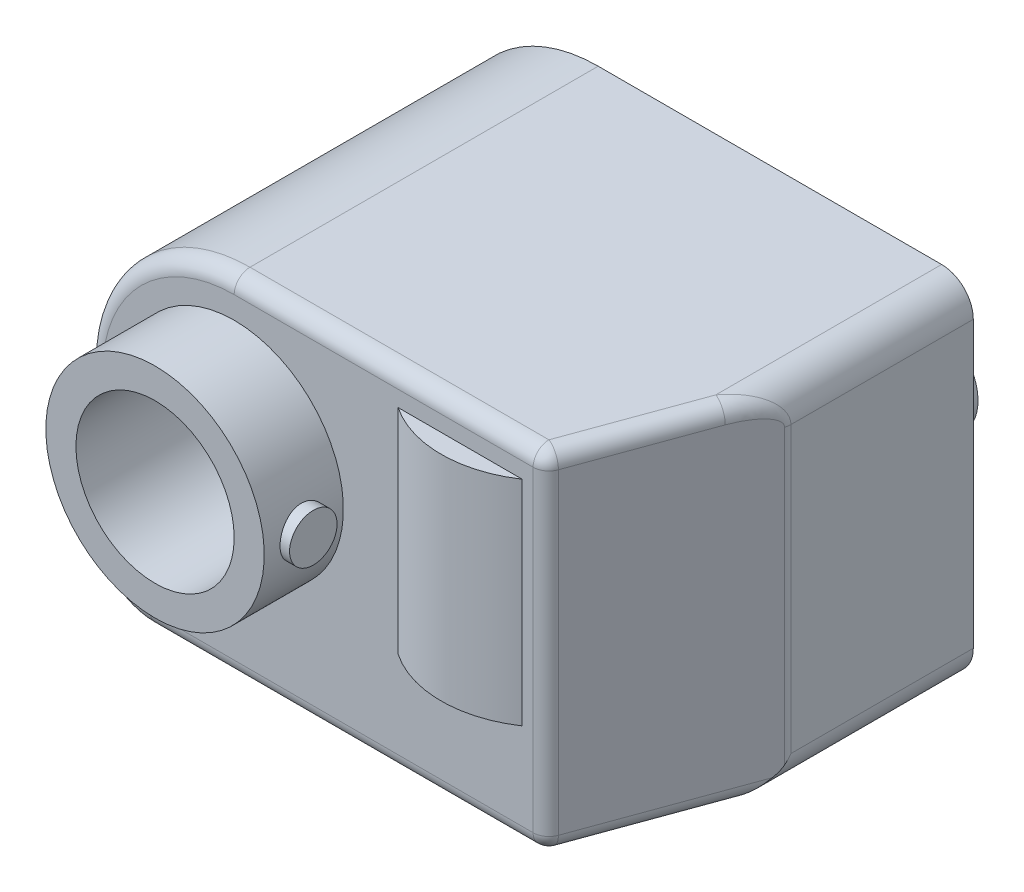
ISO-10303-21;
HEADER;
FILE_DESCRIPTION(('STEP AP214'),'2;1');
FILE_NAME('part.step','',(''),(''),'','','');
FILE_SCHEMA(('AUTOMOTIVE_DESIGN { 1 0 10303 214 1 1 1 1 }'));
ENDSEC;
DATA;
#1=APPLICATION_CONTEXT('core data for automotive mechanical design processes');
#2=APPLICATION_PROTOCOL_DEFINITION('international standard','automotive_design',2000,#1);
#3=PRODUCT_CONTEXT('',#1,'mechanical');
#4=PRODUCT('Part','Part','',(#3));
#5=PRODUCT_RELATED_PRODUCT_CATEGORY('part','',(#4));
#6=PRODUCT_DEFINITION_FORMATION('','',#4);
#7=PRODUCT_DEFINITION_CONTEXT('part definition',#1,'design');
#8=PRODUCT_DEFINITION('design','',#6,#7);
#9=PRODUCT_DEFINITION_SHAPE('','',#8);
#10=(LENGTH_UNIT() NAMED_UNIT(*) SI_UNIT(.MILLI.,.METRE.));
#11=(NAMED_UNIT(*) PLANE_ANGLE_UNIT() SI_UNIT($,.RADIAN.));
#12=(NAMED_UNIT(*) SI_UNIT($,.STERADIAN.) SOLID_ANGLE_UNIT());
#13=UNCERTAINTY_MEASURE_WITH_UNIT(LENGTH_MEASURE(1.E-05),#10,'distance_accuracy_value','');
#14=(GEOMETRIC_REPRESENTATION_CONTEXT(3) GLOBAL_UNCERTAINTY_ASSIGNED_CONTEXT((#13)) GLOBAL_UNIT_ASSIGNED_CONTEXT((#10,
#11,#12)) REPRESENTATION_CONTEXT('',''));
#15=CARTESIAN_POINT('',(0.,0.,0.));
#16=DIRECTION('',(0.,0.,1.));
#17=DIRECTION('',(1.,0.,0.));
#18=AXIS2_PLACEMENT_3D('',#15,#16,#17);
#19=CARTESIAN_POINT('',(18.,0.,-5.));
#20=DIRECTION('',(0.,0.,1.));
#21=DIRECTION('',(0.,-1.,0.));
#22=AXIS2_PLACEMENT_3D('',#19,#20,#21);
#23=CYLINDRICAL_SURFACE('',#22,3.);
#24=CARTESIAN_POINT('',(18.,0.,0.));
#25=DIRECTION('',(0.,0.,1.));
#26=DIRECTION('',(0.,-1.,0.));
#27=AXIS2_PLACEMENT_3D('',#24,#25,#26);
#28=CIRCLE('',#27,3.);
#29=CARTESIAN_POINT('',(18.,-3.,0.));
#30=VERTEX_POINT('',#29);
#31=EDGE_CURVE('E157',#30,#30,#28,.T.);
#32=ORIENTED_EDGE('',*,*,#31,.F.);
#33=EDGE_LOOP('',(#32));
#34=FACE_BOUND('',#33,.T.);
#35=CARTESIAN_POINT('',(18.,0.,-3.));
#36=DIRECTION('',(0.,0.,-1.));
#37=DIRECTION('',(-1.,0.,0.));
#38=AXIS2_PLACEMENT_3D('',#35,#36,#37);
#39=CIRCLE('',#38,3.);
#40=CARTESIAN_POINT('',(15.,0.,-3.));
#41=VERTEX_POINT('',#40);
#42=EDGE_CURVE('E514',#41,#41,#39,.T.);
#43=ORIENTED_EDGE('',*,*,#42,.F.);
#44=EDGE_LOOP('',(#43));
#45=FACE_BOUND('',#44,.T.);
#46=ADVANCED_FACE('F14',(#34,#45),#23,.T.);
#47=CARTESIAN_POINT('',(-5.3,-8.7,23.));
#48=DIRECTION('',(0.,0.,1.));
#49=DIRECTION('',(0.,-1.,0.));
#50=AXIS2_PLACEMENT_3D('',#47,#48,#49);
#51=PLANE('',#50);
#52=CARTESIAN_POINT('',(0.,0.,23.));
#53=DIRECTION('',(0.,0.,1.));
#54=DIRECTION('',(0.,-1.,0.));
#55=AXIS2_PLACEMENT_3D('',#52,#53,#54);
#56=CIRCLE('',#55,6.9);
#57=CARTESIAN_POINT('',(0.,-6.9,23.));
#58=VERTEX_POINT('',#57);
#59=EDGE_CURVE('E409',#58,#58,#56,.T.);
#60=ORIENTED_EDGE('',*,*,#59,.F.);
#61=EDGE_LOOP('',(#60));
#62=FACE_BOUND('',#61,.T.);
#63=DIRECTION('',(1.,0.,0.));
#64=VECTOR('',#63,1.);
#65=CARTESIAN_POINT('',(19.587136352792,-11.7,23.));
#66=LINE('',#65,#64);
#67=CARTESIAN_POINT('',(-5.3,-11.7,23.));
#68=VERTEX_POINT('',#67);
#69=CARTESIAN_POINT('',(18.8869288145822,-11.7,23.));
#70=VERTEX_POINT('',#69);
#71=EDGE_CURVE('E292',#68,#70,#66,.T.);
#72=ORIENTED_EDGE('',*,*,#71,.T.);
#73=DIRECTION('',(0.,-1.,0.));
#74=VECTOR('',#73,1.);
#75=CARTESIAN_POINT('',(18.8869288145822,9.3,23.));
#76=LINE('',#75,#74);
#77=CARTESIAN_POINT('',(18.8869288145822,8.3,23.));
#78=VERTEX_POINT('',#77);
#79=EDGE_CURVE('E297',#70,#78,#76,.F.);
#80=ORIENTED_EDGE('',*,*,#79,.T.);
#81=DIRECTION('',(-1.,0.,0.));
#82=VECTOR('',#81,1.);
#83=CARTESIAN_POINT('',(0.,8.3,23.));
#84=LINE('',#83,#82);
#85=CARTESIAN_POINT('',(0.,8.3,23.));
#86=VERTEX_POINT('',#85);
#87=EDGE_CURVE('E295',#78,#86,#84,.T.);
#88=ORIENTED_EDGE('',*,*,#87,.T.);
#89=CARTESIAN_POINT('',(0.,0.,23.));
#90=DIRECTION('',(0.,0.,1.));
#91=DIRECTION('',(0.,-1.,0.));
#92=AXIS2_PLACEMENT_3D('',#89,#90,#91);
#93=CIRCLE('',#92,8.3);
#94=CARTESIAN_POINT('',(-8.3,0.,23.));
#95=VERTEX_POINT('',#94);
#96=EDGE_CURVE('E286',#86,#95,#93,.T.);
#97=ORIENTED_EDGE('',*,*,#96,.T.);
#98=DIRECTION('',(0.,-1.,0.));
#99=VECTOR('',#98,1.);
#100=CARTESIAN_POINT('',(-8.3,-8.7,23.));
#101=LINE('',#100,#99);
#102=CARTESIAN_POINT('',(-8.3,-8.7,23.));
#103=VERTEX_POINT('',#102);
#104=EDGE_CURVE('E288',#95,#103,#101,.T.);
#105=ORIENTED_EDGE('',*,*,#104,.T.);
#106=CARTESIAN_POINT('',(-5.3,-8.7,23.));
#107=DIRECTION('',(0.,0.,1.));
#108=DIRECTION('',(0.,-1.,0.));
#109=AXIS2_PLACEMENT_3D('',#106,#107,#108);
#110=CIRCLE('',#109,3.);
#111=EDGE_CURVE('E290',#103,#68,#110,.T.);
#112=ORIENTED_EDGE('',*,*,#111,.T.);
#113=EDGE_LOOP('',(#72,#80,#88,#97,#105,#112));
#114=FACE_BOUND('',#113,.T.);
#115=DIRECTION('',(0.,-1.,0.));
#116=VECTOR('',#115,1.);
#117=CARTESIAN_POINT('',(10.3582423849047,7.3,23.));
#118=LINE('',#117,#116);
#119=CARTESIAN_POINT('',(10.3582423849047,7.3,23.));
#120=VERTEX_POINT('',#119);
#121=CARTESIAN_POINT('',(10.3582423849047,-6.2,23.));
#122=VERTEX_POINT('',#121);
#123=EDGE_CURVE('E30',#120,#122,#118,.T.);
#124=ORIENTED_EDGE('',*,*,#123,.F.);
#125=DIRECTION('',(1.,0.,0.));
#126=VECTOR('',#125,1.);
#127=CARTESIAN_POINT('',(10.3582423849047,7.3,23.));
#128=LINE('',#127,#126);
#129=CARTESIAN_POINT('',(18.1966095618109,7.3,23.));
#130=VERTEX_POINT('',#129);
#131=EDGE_CURVE('E35',#120,#130,#128,.T.);
#132=ORIENTED_EDGE('',*,*,#131,.T.);
#133=DIRECTION('',(0.,-1.,0.));
#134=VECTOR('',#133,1.);
#135=CARTESIAN_POINT('',(18.1966095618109,7.3,23.));
#136=LINE('',#135,#134);
#137=CARTESIAN_POINT('',(18.1966095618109,-6.2,23.));
#138=VERTEX_POINT('',#137);
#139=EDGE_CURVE('E130',#130,#138,#136,.T.);
#140=ORIENTED_EDGE('',*,*,#139,.T.);
#141=DIRECTION('',(1.,0.,0.));
#142=VECTOR('',#141,1.);
#143=CARTESIAN_POINT('',(10.3582423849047,-6.2,23.));
#144=LINE('',#143,#142);
#145=EDGE_CURVE('E134',#122,#138,#144,.T.);
#146=ORIENTED_EDGE('',*,*,#145,.F.);
#147=EDGE_LOOP('',(#124,#132,#140,#146));
#148=FACE_BOUND('',#147,.T.);
#149=ADVANCED_FACE('F132',(#62,#114,#148),#51,.T.);
#150=CARTESIAN_POINT('',(-5.3,-8.7,0.));
#151=DIRECTION('',(0.,0.,1.));
#152=DIRECTION('',(0.,-1.,0.));
#153=AXIS2_PLACEMENT_3D('',#150,#151,#152);
#154=PLANE('',#153);
#155=ORIENTED_EDGE('',*,*,#31,.T.);
#156=EDGE_LOOP('',(#155));
#157=FACE_BOUND('',#156,.T.);
#158=CARTESIAN_POINT('',(-5.3,-8.7,0.));
#159=DIRECTION('',(0.,0.,1.));
#160=DIRECTION('',(0.,-1.,0.));
#161=AXIS2_PLACEMENT_3D('',#158,#159,#160);
#162=CIRCLE('',#161,4.);
#163=CARTESIAN_POINT('',(-9.3,-8.7,0.));
#164=VERTEX_POINT('',#163);
#165=CARTESIAN_POINT('',(-5.3,-12.7,0.));
#166=VERTEX_POINT('',#165);
#167=EDGE_CURVE('E415',#164,#166,#162,.T.);
#168=ORIENTED_EDGE('',*,*,#167,.F.);
#169=DIRECTION('',(0.,-1.,0.));
#170=VECTOR('',#169,1.);
#171=CARTESIAN_POINT('',(-9.3,0.,0.));
#172=LINE('',#171,#170);
#173=CARTESIAN_POINT('',(-9.3,0.,0.));
#174=VERTEX_POINT('',#173);
#175=EDGE_CURVE('E433',#174,#164,#172,.T.);
#176=ORIENTED_EDGE('',*,*,#175,.F.);
#177=CARTESIAN_POINT('',(0.,0.,0.));
#178=DIRECTION('',(0.,0.,1.));
#179=DIRECTION('',(0.,-1.,0.));
#180=AXIS2_PLACEMENT_3D('',#177,#178,#179);
#181=CIRCLE('',#180,9.3);
#182=CARTESIAN_POINT('',(0.,9.3,0.));
#183=VERTEX_POINT('',#182);
#184=EDGE_CURVE('E430',#183,#174,#181,.T.);
#185=ORIENTED_EDGE('',*,*,#184,.F.);
#186=DIRECTION('',(-1.,0.,0.));
#187=VECTOR('',#186,1.);
#188=CARTESIAN_POINT('',(0.,9.3,0.));
#189=LINE('',#188,#187);
#190=CARTESIAN_POINT('',(21.6999999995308,9.3,0.));
#191=VERTEX_POINT('',#190);
#192=EDGE_CURVE('E427',#191,#183,#189,.T.);
#193=ORIENTED_EDGE('',*,*,#192,.F.);
#194=CARTESIAN_POINT('',(21.6999999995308,7.3,0.));
#195=DIRECTION('',(0.,0.,1.));
#196=DIRECTION('',(0.,1.,0.));
#197=AXIS2_PLACEMENT_3D('',#194,#195,#196);
#198=CIRCLE('',#197,2.);
#199=CARTESIAN_POINT('',(23.6999999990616,7.30004332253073,0.));
#200=VERTEX_POINT('',#199);
#201=EDGE_CURVE('E424',#200,#191,#198,.T.);
#202=ORIENTED_EDGE('',*,*,#201,.F.);
#203=DIRECTION('',(-2.16612653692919E-05,0.999999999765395,0.));
#204=VECTOR('',#203,1.);
#205=CARTESIAN_POINT('',(23.6999999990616,7.30004332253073,0.));
#206=LINE('',#205,#204);
#207=CARTESIAN_POINT('',(23.7003899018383,-10.6999566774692,0.));
#208=VERTEX_POINT('',#207);
#209=EDGE_CURVE('E421',#208,#200,#206,.T.);
#210=ORIENTED_EDGE('',*,*,#209,.F.);
#211=CARTESIAN_POINT('',(21.7003899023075,-10.7,0.));
#212=DIRECTION('',(0.,0.,1.));
#213=DIRECTION('',(0.,1.,0.));
#214=AXIS2_PLACEMENT_3D('',#211,#212,#213);
#215=CIRCLE('',#214,2.);
#216=CARTESIAN_POINT('',(21.7003899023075,-12.7,0.));
#217=VERTEX_POINT('',#216);
#218=EDGE_CURVE('E419',#217,#208,#215,.T.);
#219=ORIENTED_EDGE('',*,*,#218,.F.);
#220=DIRECTION('',(1.,0.,0.));
#221=VECTOR('',#220,1.);
#222=CARTESIAN_POINT('',(-5.3,-12.7,0.));
#223=LINE('',#222,#221);
#224=EDGE_CURVE('E350',#166,#217,#223,.T.);
#225=ORIENTED_EDGE('',*,*,#224,.F.);
#226=EDGE_LOOP('',(#168,#176,#185,#193,#202,#210,#219,#225));
#227=FACE_BOUND('',#226,.T.);
#228=CARTESIAN_POINT('',(0.,0.,0.));
#229=DIRECTION('',(0.,0.,1.));
#230=DIRECTION('',(0.,-1.,0.));
#231=AXIS2_PLACEMENT_3D('',#228,#229,#230);
#232=CIRCLE('',#231,8.);
#233=CARTESIAN_POINT('',(0.,-8.,0.));
#234=VERTEX_POINT('',#233);
#235=EDGE_CURVE('E403',#234,#234,#232,.T.);
#236=ORIENTED_EDGE('',*,*,#235,.T.);
#237=EDGE_LOOP('',(#236));
#238=FACE_BOUND('',#237,.T.);
#239=ADVANCED_FACE('F219',(#157,#227,#238),#154,.F.);
#240=CARTESIAN_POINT('',(-5.3,-8.7,23.));
#241=DIRECTION('',(0.,0.,-1.));
#242=DIRECTION('',(0.,1.,0.));
#243=AXIS2_PLACEMENT_3D('',#240,#241,#242);
#244=CYLINDRICAL_SURFACE('',#243,4.);
#245=DIRECTION('',(0.,0.,-1.));
#246=VECTOR('',#245,1.);
#247=CARTESIAN_POINT('',(-5.3,-12.7,23.));
#248=LINE('',#247,#246);
#249=CARTESIAN_POINT('',(-5.3,-12.7,22.));
#250=VERTEX_POINT('',#249);
#251=EDGE_CURVE('E281',#250,#166,#248,.T.);
#252=ORIENTED_EDGE('',*,*,#251,.F.);
#253=CARTESIAN_POINT('',(-5.3,-8.7,22.));
#254=DIRECTION('',(0.,0.,1.));
#255=DIRECTION('',(0.,-1.,0.));
#256=AXIS2_PLACEMENT_3D('',#253,#254,#255);
#257=CIRCLE('',#256,4.);
#258=CARTESIAN_POINT('',(-9.3,-8.7,22.));
#259=VERTEX_POINT('',#258);
#260=EDGE_CURVE('E304',#250,#259,#257,.F.);
#261=ORIENTED_EDGE('',*,*,#260,.T.);
#262=DIRECTION('',(0.,0.,-1.));
#263=VECTOR('',#262,1.);
#264=CARTESIAN_POINT('',(-9.3,-8.7,23.));
#265=LINE('',#264,#263);
#266=EDGE_CURVE('E436',#259,#164,#265,.T.);
#267=ORIENTED_EDGE('',*,*,#266,.T.);
#268=ORIENTED_EDGE('',*,*,#167,.T.);
#269=EDGE_LOOP('',(#252,#261,#267,#268));
#270=FACE_BOUND('',#269,.T.);
#271=ADVANCED_FACE('F16',(#270),#244,.T.);
#272=CARTESIAN_POINT('',(-5.3,-12.7,23.));
#273=DIRECTION('',(0.,1.,0.));
#274=DIRECTION('',(-1.,0.,0.));
#275=AXIS2_PLACEMENT_3D('',#272,#273,#274);
#276=PLANE('',#275);
#277=DIRECTION('',(0.,0.,-1.));
#278=VECTOR('',#277,1.);
#279=CARTESIAN_POINT('',(21.7003899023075,-12.7,23.));
#280=LINE('',#279,#278);
#281=CARTESIAN_POINT('',(21.7003899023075,-12.7,14.2700791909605));
#282=VERTEX_POINT('',#281);
#283=EDGE_CURVE('E279',#282,#217,#280,.T.);
#284=ORIENTED_EDGE('',*,*,#283,.F.);
#285=DIRECTION('',(-0.342020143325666,0.,0.939692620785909));
#286=VECTOR('',#285,1.);
#287=CARTESIAN_POINT('',(15.7362018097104,-12.7,30.6565513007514));
#288=LINE('',#287,#286);
#289=CARTESIAN_POINT('',(18.8869288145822,-12.7,22.));
#290=VERTEX_POINT('',#289);
#291=EDGE_CURVE('E310',#282,#290,#288,.T.);
#292=ORIENTED_EDGE('',*,*,#291,.T.);
#293=DIRECTION('',(1.,0.,0.));
#294=VECTOR('',#293,1.);
#295=CARTESIAN_POINT('',(-5.3,-12.7,22.));
#296=LINE('',#295,#294);
#297=EDGE_CURVE('E302',#290,#250,#296,.F.);
#298=ORIENTED_EDGE('',*,*,#297,.T.);
#299=ORIENTED_EDGE('',*,*,#251,.T.);
#300=ORIENTED_EDGE('',*,*,#224,.T.);
#301=EDGE_LOOP('',(#284,#292,#298,#299,#300));
#302=FACE_BOUND('',#301,.T.);
#303=ADVANCED_FACE('F336',(#302),#276,.F.);
#304=CARTESIAN_POINT('',(21.7003899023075,-10.7,23.));
#305=DIRECTION('',(0.,0.,-1.));
#306=DIRECTION('',(0.,1.,0.));
#307=AXIS2_PLACEMENT_3D('',#304,#305,#306);
#308=CYLINDRICAL_SURFACE('',#307,2.);
#309=CARTESIAN_POINT('',(21.7003899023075,-10.7,17.1938835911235));
#310=DIRECTION('',(-0.939692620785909,0.,-0.342020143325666));
#311=DIRECTION('',(0.342020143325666,0.,-0.939692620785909));
#312=AXIS2_PLACEMENT_3D('',#309,#310,#311);
#313=ELLIPSE('',#312,5.84760880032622,2.);
#314=CARTESIAN_POINT('',(23.6400930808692,-11.1873926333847,11.8645929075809));
#315=VERTEX_POINT('',#314);
#316=CARTESIAN_POINT('',(23.4324407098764,-11.7,12.4351131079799));
#317=VERTEX_POINT('',#316);
#318=EDGE_CURVE('E388',#315,#317,#313,.T.);
#319=ORIENTED_EDGE('',*,*,#318,.T.);
#320=CARTESIAN_POINT('',(23.4324407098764,-11.7,12.4351131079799));
#321=CARTESIAN_POINT('',(23.4076435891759,-11.7429748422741,12.5033279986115));
#322=CARTESIAN_POINT('',(23.3803123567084,-11.7865955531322,12.5702335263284));
#323=CARTESIAN_POINT('',(23.3202990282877,-11.8741812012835,12.7013998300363));
#324=CARTESIAN_POINT('',(23.2876151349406,-11.9181462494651,12.7656597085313));
#325=CARTESIAN_POINT('',(23.2165334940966,-12.0055617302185,12.8916340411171));
#326=CARTESIAN_POINT('',(23.1781204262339,-12.0490104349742,12.9533410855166));
#327=CARTESIAN_POINT('',(23.0956015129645,-12.1341897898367,13.0740661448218));
#328=CARTESIAN_POINT('',(23.0514962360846,-12.1759206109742,13.1330844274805));
#329=CARTESIAN_POINT('',(22.9503425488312,-12.2629254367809,13.2576519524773));
#330=CARTESIAN_POINT('',(22.8923493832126,-12.3077253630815,13.3227696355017));
#331=CARTESIAN_POINT('',(22.7694443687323,-12.3919437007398,13.4499293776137));
#332=CARTESIAN_POINT('',(22.7045306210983,-12.4313606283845,13.511970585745));
#333=CARTESIAN_POINT('',(22.5689261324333,-12.503194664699,13.6332098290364));
#334=CARTESIAN_POINT('',(22.4982558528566,-12.5356351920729,13.6924168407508));
#335=CARTESIAN_POINT('',(22.3521671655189,-12.5924386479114,13.8087321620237));
#336=CARTESIAN_POINT('',(22.2767513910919,-12.6168060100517,13.865841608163));
#337=CARTESIAN_POINT('',(22.1215572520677,-12.6568146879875,13.9793436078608));
#338=CARTESIAN_POINT('',(22.0417351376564,-12.6723392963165,14.0357173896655));
#339=CARTESIAN_POINT('',(21.8803128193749,-12.6935502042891,14.1476502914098));
#340=CARTESIAN_POINT('',(21.798714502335,-12.6992464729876,14.2032101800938));
#341=CARTESIAN_POINT('',(21.7115365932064,-12.699976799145,14.2624990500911));
#342=CARTESIAN_POINT('',(21.7059631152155,-12.7000001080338,14.2662892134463));
#343=CARTESIAN_POINT('',(21.7003899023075,-12.7,14.2700791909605));
#344=B_SPLINE_CURVE_WITH_KNOTS('',3,(#320,#321,#322,#323,#324,#325,#326,#327,#328,#329,#330,
#331,#332,#333,#334,#335,#336,#337,#338,#339,#340,#341,#342,#343),.UNSPECIFIED.,.F.,.F.,(4,2,2,
2,2,2,2,2,2,2,2,4),(0.,0.253025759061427,0.506136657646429,0.759936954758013,1.01371192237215,
1.30737558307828,1.60112002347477,1.89386246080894,2.18644386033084,2.4828022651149,
2.778859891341,2.79908013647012),.UNSPECIFIED.);
#345=EDGE_CURVE('E327',#317,#282,#344,.T.);
#346=ORIENTED_EDGE('',*,*,#345,.T.);
#347=ORIENTED_EDGE('',*,*,#283,.T.);
#348=ORIENTED_EDGE('',*,*,#218,.T.);
#349=DIRECTION('',(0.,0.,-1.));
#350=VECTOR('',#349,1.);
#351=CARTESIAN_POINT('',(23.7003899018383,-10.6999566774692,23.));
#352=LINE('',#351,#350);
#353=CARTESIAN_POINT('',(23.7003899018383,-10.6999566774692,11.5226017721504));
#354=VERTEX_POINT('',#353);
#355=EDGE_CURVE('E271',#354,#208,#352,.T.);
#356=ORIENTED_EDGE('',*,*,#355,.F.);
#357=CARTESIAN_POINT('',(23.6400930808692,-11.1873926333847,11.8645929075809));
#358=CARTESIAN_POINT('',(23.6600435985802,-11.1078864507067,11.8096933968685));
#359=CARTESIAN_POINT('',(23.6749937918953,-11.0278204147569,11.7537451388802));
#360=CARTESIAN_POINT('',(23.6949905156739,-10.8675738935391,11.6411085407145));
#361=CARTESIAN_POINT('',(23.70008619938,-10.7873959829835,11.5844253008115));
#362=CARTESIAN_POINT('',(23.7003855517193,-10.7048254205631,11.5260442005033));
#363=CARTESIAN_POINT('',(23.7003899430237,-10.7023910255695,11.5243229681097));
#364=CARTESIAN_POINT('',(23.7003899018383,-10.6999566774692,11.5226017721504));
#365=B_SPLINE_CURVE_WITH_KNOTS('',3,(#357,#358,#359,#360,#361,#362,#363,#364),.UNSPECIFIED.,.F.,
.F.,(4,2,2,4),(0.,0.295905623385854,0.590331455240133,0.599275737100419),.UNSPECIFIED.);
#366=EDGE_CURVE('E321',#354,#315,#365,.F.);
#367=ORIENTED_EDGE('',*,*,#366,.T.);
#368=EDGE_LOOP('',(#319,#346,#347,#348,#356,#367));
#369=FACE_BOUND('',#368,.T.);
#370=ADVANCED_FACE('F332',(#369),#308,.T.);
#371=CARTESIAN_POINT('',(23.6999999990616,7.30004332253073,23.));
#372=DIRECTION('',(-0.999999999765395,-2.16612653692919E-05,0.));
#373=DIRECTION('',(2.16612653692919E-05,-0.999999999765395,0.));
#374=AXIS2_PLACEMENT_3D('',#371,#372,#373);
#375=PLANE('',#374);
#376=DIRECTION('',(0.,0.,-1.));
#377=VECTOR('',#376,1.);
#378=CARTESIAN_POINT('',(23.6999999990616,7.30004332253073,23.));
#379=LINE('',#378,#377);
#380=CARTESIAN_POINT('',(23.6999999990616,7.30004332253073,11.5236730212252));
#381=VERTEX_POINT('',#380);
#382=EDGE_CURVE('E268',#381,#200,#379,.T.);
#383=ORIENTED_EDGE('',*,*,#382,.F.);
#384=DIRECTION('',(2.16612653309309E-05,-0.999999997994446,-5.95138373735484E-05));
#385=VECTOR('',#384,1.);
#386=CARTESIAN_POINT('',(23.699999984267,7.30072632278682,11.5236730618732));
#387=LINE('',#386,#385);
#388=EDGE_CURVE('E263',#381,#354,#387,.T.);
#389=ORIENTED_EDGE('',*,*,#388,.T.);
#390=ORIENTED_EDGE('',*,*,#355,.T.);
#391=ORIENTED_EDGE('',*,*,#209,.T.);
#392=EDGE_LOOP('',(#383,#389,#390,#391));
#393=FACE_BOUND('',#392,.T.);
#394=ADVANCED_FACE('F335',(#393),#375,.F.);
#395=CARTESIAN_POINT('',(21.6999999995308,7.3,23.));
#396=DIRECTION('',(0.,0.,-1.));
#397=DIRECTION('',(0.,1.,0.));
#398=AXIS2_PLACEMENT_3D('',#395,#396,#397);
#399=CYLINDRICAL_SURFACE('',#398,2.);
#400=DIRECTION('',(0.,0.,-1.));
#401=VECTOR('',#400,1.);
#402=CARTESIAN_POINT('',(21.6999999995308,9.3,23.));
#403=LINE('',#402,#401);
#404=CARTESIAN_POINT('',(21.6999999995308,9.3,14.2711504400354));
#405=VERTEX_POINT('',#404);
#406=EDGE_CURVE('E272',#405,#191,#403,.T.);
#407=ORIENTED_EDGE('',*,*,#406,.F.);
#408=CARTESIAN_POINT('',(21.6999999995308,7.3,14.2711504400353));
#409=DIRECTION('',(0.808479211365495,0.,0.588524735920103));
#410=DIRECTION('',(0.588524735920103,0.,-0.808479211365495));
#411=AXIS2_PLACEMENT_3D('',#408,#409,#410);
#412=ELLIPSE('',#411,3.39832784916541,2.);
#413=EDGE_CURVE('E265',#405,#381,#412,.F.);
#414=ORIENTED_EDGE('',*,*,#413,.T.);
#415=ORIENTED_EDGE('',*,*,#382,.T.);
#416=ORIENTED_EDGE('',*,*,#201,.T.);
#417=EDGE_LOOP('',(#407,#414,#415,#416));
#418=FACE_BOUND('',#417,.T.);
#419=ADVANCED_FACE('F185',(#418),#399,.T.);
#420=CARTESIAN_POINT('',(0.,9.3,23.));
#421=DIRECTION('',(0.,-1.,0.));
#422=DIRECTION('',(1.,0.,0.));
#423=AXIS2_PLACEMENT_3D('',#420,#421,#422);
#424=PLANE('',#423);
#425=DIRECTION('',(-1.,0.,0.));
#426=VECTOR('',#425,1.);
#427=CARTESIAN_POINT('',(19.587136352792,9.3,22.));
#428=LINE('',#427,#426);
#429=CARTESIAN_POINT('',(0.,9.3,22.));
#430=VERTEX_POINT('',#429);
#431=CARTESIAN_POINT('',(18.8869288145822,9.3,22.));
#432=VERTEX_POINT('',#431);
#433=EDGE_CURVE('E300',#430,#432,#428,.F.);
#434=ORIENTED_EDGE('',*,*,#433,.T.);
#435=DIRECTION('',(0.342020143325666,0.,-0.939692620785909));
#436=VECTOR('',#435,1.);
#437=CARTESIAN_POINT('',(16.3561840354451,9.3,28.953164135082));
#438=LINE('',#437,#436);
#439=EDGE_CURVE('E267',#432,#405,#438,.T.);
#440=ORIENTED_EDGE('',*,*,#439,.T.);
#441=ORIENTED_EDGE('',*,*,#406,.T.);
#442=ORIENTED_EDGE('',*,*,#192,.T.);
#443=DIRECTION('',(0.,0.,-1.));
#444=VECTOR('',#443,1.);
#445=CARTESIAN_POINT('',(0.,9.3,23.));
#446=LINE('',#445,#444);
#447=EDGE_CURVE('E439',#430,#183,#446,.T.);
#448=ORIENTED_EDGE('',*,*,#447,.F.);
#449=EDGE_LOOP('',(#434,#440,#441,#442,#448));
#450=FACE_BOUND('',#449,.T.);
#451=ADVANCED_FACE('F445',(#450),#424,.F.);
#452=CARTESIAN_POINT('',(0.,0.,23.));
#453=DIRECTION('',(0.,0.,-1.));
#454=DIRECTION('',(0.,1.,0.));
#455=AXIS2_PLACEMENT_3D('',#452,#453,#454);
#456=CYLINDRICAL_SURFACE('',#455,9.3);
#457=DIRECTION('',(0.,0.,-1.));
#458=VECTOR('',#457,1.);
#459=CARTESIAN_POINT('',(-9.3,0.,23.));
#460=LINE('',#459,#458);
#461=CARTESIAN_POINT('',(-9.3,0.,22.));
#462=VERTEX_POINT('',#461);
#463=EDGE_CURVE('E438',#462,#174,#460,.T.);
#464=ORIENTED_EDGE('',*,*,#463,.F.);
#465=CARTESIAN_POINT('',(0.,0.,22.));
#466=DIRECTION('',(0.,0.,1.));
#467=DIRECTION('',(0.,-1.,0.));
#468=AXIS2_PLACEMENT_3D('',#465,#466,#467);
#469=CIRCLE('',#468,9.3);
#470=EDGE_CURVE('E308',#462,#430,#469,.F.);
#471=ORIENTED_EDGE('',*,*,#470,.T.);
#472=ORIENTED_EDGE('',*,*,#447,.T.);
#473=ORIENTED_EDGE('',*,*,#184,.T.);
#474=EDGE_LOOP('',(#464,#471,#472,#473));
#475=FACE_BOUND('',#474,.T.);
#476=ADVANCED_FACE('F458',(#475),#456,.T.);
#477=CARTESIAN_POINT('',(-9.3,0.,23.));
#478=DIRECTION('',(1.,0.,0.));
#479=DIRECTION('',(0.,0.,1.));
#480=AXIS2_PLACEMENT_3D('',#477,#478,#479);
#481=PLANE('',#480);
#482=ORIENTED_EDGE('',*,*,#266,.F.);
#483=DIRECTION('',(0.,-1.,0.));
#484=VECTOR('',#483,1.);
#485=CARTESIAN_POINT('',(-9.3,0.,22.));
#486=LINE('',#485,#484);
#487=EDGE_CURVE('E306',#259,#462,#486,.F.);
#488=ORIENTED_EDGE('',*,*,#487,.T.);
#489=ORIENTED_EDGE('',*,*,#463,.T.);
#490=ORIENTED_EDGE('',*,*,#175,.T.);
#491=EDGE_LOOP('',(#482,#488,#489,#490));
#492=FACE_BOUND('',#491,.T.);
#493=ADVANCED_FACE('F217',(#492),#481,.F.);
#494=CARTESIAN_POINT('',(0.,0.,28.));
#495=DIRECTION('',(0.,0.,-1.));
#496=DIRECTION('',(0.,1.,0.));
#497=AXIS2_PLACEMENT_3D('',#494,#495,#496);
#498=CYLINDRICAL_SURFACE('',#497,6.9);
#499=CARTESIAN_POINT('',(6.9,0.,27.));
#500=CARTESIAN_POINT('',(6.89999846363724,0.0832066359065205,26.9999971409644));
#501=CARTESIAN_POINT('',(6.89847961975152,0.166447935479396,26.993053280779));
#502=CARTESIAN_POINT('',(6.89256733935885,0.330566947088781,26.9654896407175));
#503=CARTESIAN_POINT('',(6.88817183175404,0.411442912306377,26.9448600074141));
#504=CARTESIAN_POINT('',(6.87699573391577,0.56843559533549,26.8906008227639));
#505=CARTESIAN_POINT('',(6.87021762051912,0.644557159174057,26.8569847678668));
#506=CARTESIAN_POINT('',(6.8550082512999,0.790076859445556,26.7777496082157));
#507=CARTESIAN_POINT('',(6.8465770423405,0.859475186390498,26.7321308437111));
#508=CARTESIAN_POINT('',(6.82883589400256,0.990682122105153,26.629419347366));
#509=CARTESIAN_POINT('',(6.81951516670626,1.05236881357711,26.5721727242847));
#510=CARTESIAN_POINT('',(6.80112168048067,1.16534439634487,26.448160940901));
#511=CARTESIAN_POINT('',(6.79204894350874,1.21663236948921,26.3813949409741));
#512=CARTESIAN_POINT('',(6.77507239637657,1.30789114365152,26.2393400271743));
#513=CARTESIAN_POINT('',(6.76718241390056,1.34773241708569,26.1639661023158));
#514=CARTESIAN_POINT('',(6.75361942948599,1.41413606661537,26.0073931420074));
#515=CARTESIAN_POINT('',(6.7479461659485,1.44070000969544,25.9261947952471));
#516=CARTESIAN_POINT('',(6.73956878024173,1.47939254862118,25.7615996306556));
#517=CARTESIAN_POINT('',(6.73682033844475,1.49173685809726,25.6782558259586));
#518=CARTESIAN_POINT('',(6.73447065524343,1.50231040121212,25.5106383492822));
#519=CARTESIAN_POINT('',(6.73486903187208,1.50054134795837,25.4263647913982));
#520=CARTESIAN_POINT('',(6.73872783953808,1.48311203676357,25.2608818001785));
#521=CARTESIAN_POINT('',(6.74213308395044,1.467702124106,25.1796445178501));
#522=CARTESIAN_POINT('',(6.75153471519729,1.42382503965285,25.0209365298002));
#523=CARTESIAN_POINT('',(6.75753124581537,1.39535714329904,24.9434660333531));
#524=CARTESIAN_POINT('',(6.77149432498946,1.32594164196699,24.7937856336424));
#525=CARTESIAN_POINT('',(6.77947601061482,1.28489755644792,24.7216219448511));
#526=CARTESIAN_POINT('',(6.79650074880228,1.19156262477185,24.5851134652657));
#527=CARTESIAN_POINT('',(6.80554394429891,1.13927026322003,24.5207697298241));
#528=CARTESIAN_POINT('',(6.82390971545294,1.02359684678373,24.4002860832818));
#529=CARTESIAN_POINT('',(6.83323413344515,0.960002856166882,24.3443506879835));
#530=CARTESIAN_POINT('',(6.85093580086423,0.824231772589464,24.2439057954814));
#531=CARTESIAN_POINT('',(6.85931303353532,0.752054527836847,24.1993965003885));
#532=CARTESIAN_POINT('',(6.87420311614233,0.60091781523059,24.1230176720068));
#533=CARTESIAN_POINT('',(6.88071204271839,0.521944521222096,24.0911746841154));
#534=CARTESIAN_POINT('',(6.89110292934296,0.359595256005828,24.0412675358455));
#535=CARTESIAN_POINT('',(6.89498526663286,0.276219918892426,24.0232013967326));
#536=CARTESIAN_POINT('',(6.89963193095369,0.109187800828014,24.0016576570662));
#537=CARTESIAN_POINT('',(6.90045596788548,0.025568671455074,23.9979006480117));
#538=CARTESIAN_POINT('',(6.89906039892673,-0.141102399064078,24.0043248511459));
#539=CARTESIAN_POINT('',(6.89684099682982,-0.224154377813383,24.014505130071));
#540=CARTESIAN_POINT('',(6.88964558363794,-0.386409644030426,24.0482832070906));
#541=CARTESIAN_POINT('',(6.88469964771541,-0.465644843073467,24.0717346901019));
#542=CARTESIAN_POINT('',(6.87260466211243,-0.619057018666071,24.1312272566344));
#543=CARTESIAN_POINT('',(6.8654554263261,-0.693233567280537,24.1672694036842));
#544=CARTESIAN_POINT('',(6.84959946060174,-0.835579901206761,24.2515040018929));
#545=CARTESIAN_POINT('',(6.84087215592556,-0.903650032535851,24.299860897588));
#546=CARTESIAN_POINT('',(6.8228705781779,-1.03080971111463,24.4071355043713));
#547=CARTESIAN_POINT('',(6.81359623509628,-1.08989810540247,24.466054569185));
#548=CARTESIAN_POINT('',(6.7953399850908,-1.19851973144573,24.5940624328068));
#549=CARTESIAN_POINT('',(6.78636646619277,-1.2478596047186,24.6633167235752));
#550=CARTESIAN_POINT('',(6.76992068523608,-1.33420907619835,24.809292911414));
#551=CARTESIAN_POINT('',(6.7624483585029,-1.3712192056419,24.8860144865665));
#552=CARTESIAN_POINT('',(6.74992178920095,-1.43161024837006,25.0443373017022));
#553=CARTESIAN_POINT('',(6.74485404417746,-1.45506743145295,25.1259083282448));
#554=CARTESIAN_POINT('',(6.73768574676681,-1.4879107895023,25.2919583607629));
#555=CARTESIAN_POINT('',(6.73558472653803,-1.49729918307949,25.3764369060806));
#556=CARTESIAN_POINT('',(6.73461698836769,-1.50164493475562,25.5439549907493));
#557=CARTESIAN_POINT('',(6.73568157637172,-1.49690879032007,25.6269863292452));
#558=CARTESIAN_POINT('',(6.74076988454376,-1.47382445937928,25.7910375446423));
#559=CARTESIAN_POINT('',(6.74479357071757,-1.45547642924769,25.8720574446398));
#560=CARTESIAN_POINT('',(6.75531342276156,-1.40583641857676,26.0295460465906));
#561=CARTESIAN_POINT('',(6.76180116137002,-1.37458852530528,26.1060292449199));
#562=CARTESIAN_POINT('',(6.77652152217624,-1.30007386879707,26.2527132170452));
#563=CARTESIAN_POINT('',(6.78475432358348,-1.256805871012,26.3229133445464));
#564=CARTESIAN_POINT('',(6.8022427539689,-1.15846039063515,26.4565504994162));
#565=CARTESIAN_POINT('',(6.81151553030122,-1.1031642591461,26.5198244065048));
#566=CARTESIAN_POINT('',(6.82992331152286,-0.982775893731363,26.6362956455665));
#567=CARTESIAN_POINT('',(6.83905828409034,-0.917681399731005,26.6894906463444));
#568=CARTESIAN_POINT('',(6.85629960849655,-0.778541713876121,26.7849443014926));
#569=CARTESIAN_POINT('',(6.86439132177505,-0.704392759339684,26.8270544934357));
#570=CARTESIAN_POINT('',(6.87848777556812,-0.549909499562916,26.8981474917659));
#571=CARTESIAN_POINT('',(6.88449427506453,-0.4695804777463,26.9271413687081));
#572=CARTESIAN_POINT('',(6.8926647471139,-0.324303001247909,26.9659780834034));
#573=CARTESIAN_POINT('',(6.89539849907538,-0.260143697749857,26.9787120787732));
#574=CARTESIAN_POINT('',(6.89906668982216,-0.130663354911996,26.9957239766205));
#575=CARTESIAN_POINT('',(6.90000120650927,-0.0653423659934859,27.0000022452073));
#576=CARTESIAN_POINT('',(6.9,0.,27.));
#577=B_SPLINE_CURVE_WITH_KNOTS('',3,(#499,#500,#501,#502,#503,#504,#505,#506,#507,#508,#509,
#510,#511,#512,#513,#514,#515,#516,#517,#518,#519,#520,#521,#522,#523,#524,#525,#526,#527,#528,
#529,#530,#531,#532,#533,#534,#535,#536,#537,#538,#539,#540,#541,#542,#543,#544,#545,#546,#547,
#548,#549,#550,#551,#552,#553,#554,#555,#556,#557,#558,#559,#560,#561,#562,#563,#564,#565,#566,
#567,#568,#569,#570,#571,#572,#573,#574,#575,#576),.UNSPECIFIED.,.T.,.F.,(4,2,2,2,2,2,2,2,2,2,2,
2,2,2,2,2,2,2,2,2,2,2,2,2,2,2,2,2,2,2,2,2,2,2,2,2,2,2,4),(0.,0.249380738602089,
0.498941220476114,0.748243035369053,0.997537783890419,1.25037642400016,1.50323737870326,
1.75885608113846,2.01444460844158,2.26610253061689,2.5177299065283,2.7648328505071,
3.01194950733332,3.2610115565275,3.51010718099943,3.76452178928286,4.01894089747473,
4.27389042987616,4.52880333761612,4.77871235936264,5.0286046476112,5.27579409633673,
5.52300443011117,5.77370688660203,6.02444149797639,6.27973695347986,6.53502140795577,
6.78885488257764,7.04264832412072,7.29097489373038,7.53929861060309,7.78678057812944,
8.03428797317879,8.28673978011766,8.53924990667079,8.79498727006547,9.05050837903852,
9.24635613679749,9.44219541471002),.UNSPECIFIED.);
#578=CARTESIAN_POINT('',(6.9,0.,27.));
#579=VERTEX_POINT('',#578);
#580=EDGE_CURVE('E9',#579,#579,#577,.T.);
#581=ORIENTED_EDGE('',*,*,#580,.T.);
#582=EDGE_LOOP('',(#581));
#583=FACE_BOUND('',#582,.T.);
#584=CARTESIAN_POINT('',(0.,0.,28.));
#585=DIRECTION('',(0.,0.,1.));
#586=DIRECTION('',(0.,-1.,0.));
#587=AXIS2_PLACEMENT_3D('',#584,#585,#586);
#588=CIRCLE('',#587,6.9);
#589=CARTESIAN_POINT('',(0.,-6.9,28.));
#590=VERTEX_POINT('',#589);
#591=EDGE_CURVE('E412',#590,#590,#588,.T.);
#592=ORIENTED_EDGE('',*,*,#591,.F.);
#593=EDGE_LOOP('',(#592));
#594=FACE_BOUND('',#593,.T.);
#595=ORIENTED_EDGE('',*,*,#59,.T.);
#596=EDGE_LOOP('',(#595));
#597=FACE_BOUND('',#596,.T.);
#598=ADVANCED_FACE('F212',(#583,#594,#597),#498,.T.);
#599=CARTESIAN_POINT('',(0.,0.,28.));
#600=DIRECTION('',(0.,0.,1.));
#601=DIRECTION('',(0.,-1.,0.));
#602=AXIS2_PLACEMENT_3D('',#599,#600,#601);
#603=PLANE('',#602);
#604=CARTESIAN_POINT('',(0.,0.,28.));
#605=DIRECTION('',(0.,0.,1.));
#606=DIRECTION('',(0.,-1.,0.));
#607=AXIS2_PLACEMENT_3D('',#604,#605,#606);
#608=CIRCLE('',#607,5.);
#609=CARTESIAN_POINT('',(0.,-5.,28.));
#610=VERTEX_POINT('',#609);
#611=EDGE_CURVE('E400',#610,#610,#608,.T.);
#612=ORIENTED_EDGE('',*,*,#611,.F.);
#613=EDGE_LOOP('',(#612));
#614=FACE_BOUND('',#613,.T.);
#615=ORIENTED_EDGE('',*,*,#591,.T.);
#616=EDGE_LOOP('',(#615));
#617=FACE_BOUND('',#616,.T.);
#618=ADVANCED_FACE('F208',(#614,#617),#603,.T.);
#619=CARTESIAN_POINT('',(0.,0.,5.));
#620=DIRECTION('',(0.,0.,-1.));
#621=DIRECTION('',(0.,1.,0.));
#622=AXIS2_PLACEMENT_3D('',#619,#620,#621);
#623=CYLINDRICAL_SURFACE('',#622,8.);
#624=CARTESIAN_POINT('',(0.,0.,5.));
#625=DIRECTION('',(0.,0.,1.));
#626=DIRECTION('',(0.,-1.,0.));
#627=AXIS2_PLACEMENT_3D('',#624,#625,#626);
#628=CIRCLE('',#627,8.);
#629=CARTESIAN_POINT('',(0.,-8.,5.));
#630=VERTEX_POINT('',#629);
#631=EDGE_CURVE('E406',#630,#630,#628,.T.);
#632=ORIENTED_EDGE('',*,*,#631,.T.);
#633=EDGE_LOOP('',(#632));
#634=FACE_BOUND('',#633,.T.);
#635=ORIENTED_EDGE('',*,*,#235,.F.);
#636=EDGE_LOOP('',(#635));
#637=FACE_BOUND('',#636,.T.);
#638=ADVANCED_FACE('F204',(#634,#637),#623,.F.);
#639=CARTESIAN_POINT('',(0.,0.,5.));
#640=DIRECTION('',(0.,0.,1.));
#641=DIRECTION('',(0.,-1.,0.));
#642=AXIS2_PLACEMENT_3D('',#639,#640,#641);
#643=PLANE('',#642);
#644=CARTESIAN_POINT('',(0.,0.,5.));
#645=DIRECTION('',(0.,0.,-1.));
#646=DIRECTION('',(0.,1.,0.));
#647=AXIS2_PLACEMENT_3D('',#644,#645,#646);
#648=CIRCLE('',#647,5.);
#649=CARTESIAN_POINT('',(0.,5.,5.));
#650=VERTEX_POINT('',#649);
#651=EDGE_CURVE('E392',#650,#650,#648,.T.);
#652=ORIENTED_EDGE('',*,*,#651,.F.);
#653=EDGE_LOOP('',(#652));
#654=FACE_BOUND('',#653,.T.);
#655=ORIENTED_EDGE('',*,*,#631,.F.);
#656=EDGE_LOOP('',(#655));
#657=FACE_BOUND('',#656,.T.);
#658=ADVANCED_FACE('F200',(#654,#657),#643,.F.);
#659=CARTESIAN_POINT('',(0.,0.,50.));
#660=DIRECTION('',(0.,0.,-1.));
#661=DIRECTION('',(0.,1.,0.));
#662=AXIS2_PLACEMENT_3D('',#659,#660,#661);
#663=CYLINDRICAL_SURFACE('',#662,5.);
#664=ORIENTED_EDGE('',*,*,#611,.T.);
#665=EDGE_LOOP('',(#664));
#666=FACE_BOUND('',#665,.T.);
#667=ORIENTED_EDGE('',*,*,#651,.T.);
#668=EDGE_LOOP('',(#667));
#669=FACE_BOUND('',#668,.T.);
#670=ADVANCED_FACE('F195',(#666,#669),#663,.F.);
#671=CARTESIAN_POINT('',(23.7,15.,11.7));
#672=DIRECTION('',(-0.939692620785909,0.,-0.342020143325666));
#673=DIRECTION('',(0.342020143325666,0.,-0.939692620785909));
#674=AXIS2_PLACEMENT_3D('',#671,#672,#673);
#675=PLANE('',#674);
#676=DIRECTION('',(0.,-1.,0.));
#677=VECTOR('',#676,1.);
#678=CARTESIAN_POINT('',(19.8266214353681,-12.7,22.3420201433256));
#679=LINE('',#678,#677);
#680=CARTESIAN_POINT('',(19.8266214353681,8.3,22.3420201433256));
#681=VERTEX_POINT('',#680);
#682=CARTESIAN_POINT('',(19.8266214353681,-11.7,22.3420201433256));
#683=VERTEX_POINT('',#682);
#684=EDGE_CURVE('E283',#681,#683,#679,.T.);
#685=ORIENTED_EDGE('',*,*,#684,.T.);
#686=DIRECTION('',(-0.342020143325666,0.,0.939692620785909));
#687=VECTOR('',#686,1.);
#688=CARTESIAN_POINT('',(23.7,-11.7,11.7));
#689=LINE('',#688,#687);
#690=EDGE_CURVE('E319',#683,#317,#689,.F.);
#691=ORIENTED_EDGE('',*,*,#690,.T.);
#692=ORIENTED_EDGE('',*,*,#318,.F.);
#693=DIRECTION('',(2.16612653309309E-05,-0.999999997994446,-5.95138373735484E-05));
#694=VECTOR('',#693,1.);
#695=CARTESIAN_POINT('',(23.6395258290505,14.9999888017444,11.866151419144));
#696=LINE('',#695,#694);
#697=CARTESIAN_POINT('',(23.6396926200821,7.30002166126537,11.8656931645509));
#698=VERTEX_POINT('',#697);
#699=EDGE_CURVE('E315',#315,#698,#696,.F.);
#700=ORIENTED_EDGE('',*,*,#699,.T.);
#701=CARTESIAN_POINT('',(22.6396926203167,7.3,14.613170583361));
#702=DIRECTION('',(-0.939692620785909,0.,-0.342020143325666));
#703=DIRECTION('',(0.342020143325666,0.,-0.939692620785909));
#704=AXIS2_PLACEMENT_3D('',#701,#702,#703);
#705=ELLIPSE('',#704,2.92380440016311,1.);
#706=CARTESIAN_POINT('',(22.6396926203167,8.3,14.613170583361));
#707=VERTEX_POINT('',#706);
#708=EDGE_CURVE('E313',#698,#707,#705,.F.);
#709=ORIENTED_EDGE('',*,*,#708,.T.);
#710=DIRECTION('',(0.342020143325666,0.,-0.939692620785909));
#711=VECTOR('',#710,1.);
#712=CARTESIAN_POINT('',(23.7,8.3,11.7));
#713=LINE('',#712,#711);
#714=EDGE_CURVE('E317',#707,#681,#713,.F.);
#715=ORIENTED_EDGE('',*,*,#714,.T.);
#716=EDGE_LOOP('',(#685,#691,#692,#700,#709,#715));
#717=FACE_BOUND('',#716,.T.);
#718=ADVANCED_FACE('F189',(#717),#675,.F.);
#719=CARTESIAN_POINT('',(-8.3,-8.7,22.));
#720=DIRECTION('',(0.,1.,0.));
#721=DIRECTION('',(0.,0.,1.));
#722=AXIS2_PLACEMENT_3D('',#719,#720,#721);
#723=CYLINDRICAL_SURFACE('',#722,1.);
#724=CARTESIAN_POINT('',(-8.3,-8.7,22.));
#725=DIRECTION('',(0.,-1.,0.));
#726=DIRECTION('',(1.,0.,0.));
#727=AXIS2_PLACEMENT_3D('',#724,#725,#726);
#728=CIRCLE('',#727,1.);
#729=EDGE_CURVE('E389',#103,#259,#728,.T.);
#730=ORIENTED_EDGE('',*,*,#729,.F.);
#731=ORIENTED_EDGE('',*,*,#104,.F.);
#732=CARTESIAN_POINT('',(-8.3,0.,22.));
#733=DIRECTION('',(0.,1.,0.));
#734=DIRECTION('',(0.,0.,1.));
#735=AXIS2_PLACEMENT_3D('',#732,#733,#734);
#736=CIRCLE('',#735,1.);
#737=EDGE_CURVE('E385',#462,#95,#736,.T.);
#738=ORIENTED_EDGE('',*,*,#737,.F.);
#739=ORIENTED_EDGE('',*,*,#487,.F.);
#740=EDGE_LOOP('',(#730,#731,#738,#739));
#741=FACE_BOUND('',#740,.T.);
#742=ADVANCED_FACE('F194',(#741),#723,.T.);
#743=CARTESIAN_POINT('',(0.,0.,22.));
#744=DIRECTION('',(0.,0.,1.));
#745=DIRECTION('',(0.,-1.,0.));
#746=AXIS2_PLACEMENT_3D('',#743,#744,#745);
#747=TOROIDAL_SURFACE('',#746,8.3,1.);
#748=ORIENTED_EDGE('',*,*,#737,.T.);
#749=ORIENTED_EDGE('',*,*,#96,.F.);
#750=CARTESIAN_POINT('',(0.,8.3,22.));
#751=DIRECTION('',(1.,0.,0.));
#752=DIRECTION('',(0.,0.,1.));
#753=AXIS2_PLACEMENT_3D('',#750,#751,#752);
#754=CIRCLE('',#753,1.);
#755=EDGE_CURVE('E377',#430,#86,#754,.T.);
#756=ORIENTED_EDGE('',*,*,#755,.F.);
#757=ORIENTED_EDGE('',*,*,#470,.F.);
#758=EDGE_LOOP('',(#748,#749,#756,#757));
#759=FACE_BOUND('',#758,.T.);
#760=ADVANCED_FACE('F382',(#759),#747,.T.);
#761=CARTESIAN_POINT('',(-5.3,-8.7,22.));
#762=DIRECTION('',(0.,0.,1.));
#763=DIRECTION('',(0.,-1.,0.));
#764=AXIS2_PLACEMENT_3D('',#761,#762,#763);
#765=TOROIDAL_SURFACE('',#764,3.,1.);
#766=ORIENTED_EDGE('',*,*,#729,.T.);
#767=ORIENTED_EDGE('',*,*,#260,.F.);
#768=CARTESIAN_POINT('',(-5.3,-11.7,22.));
#769=DIRECTION('',(1.,0.,0.));
#770=DIRECTION('',(0.,0.,1.));
#771=AXIS2_PLACEMENT_3D('',#768,#769,#770);
#772=CIRCLE('',#771,1.);
#773=EDGE_CURVE('E361',#68,#250,#772,.T.);
#774=ORIENTED_EDGE('',*,*,#773,.F.);
#775=ORIENTED_EDGE('',*,*,#111,.F.);
#776=EDGE_LOOP('',(#766,#767,#774,#775));
#777=FACE_BOUND('',#776,.T.);
#778=ADVANCED_FACE('F464',(#777),#765,.T.);
#779=CARTESIAN_POINT('',(-5.3,8.3,22.));
#780=DIRECTION('',(1.,0.,0.));
#781=DIRECTION('',(0.,1.,0.));
#782=AXIS2_PLACEMENT_3D('',#779,#780,#781);
#783=CYLINDRICAL_SURFACE('',#782,1.);
#784=ORIENTED_EDGE('',*,*,#87,.F.);
#785=CARTESIAN_POINT('',(18.8869288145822,8.3,22.));
#786=DIRECTION('',(1.,0.,0.));
#787=DIRECTION('',(0.,1.,0.));
#788=AXIS2_PLACEMENT_3D('',#785,#786,#787);
#789=CIRCLE('',#788,1.);
#790=EDGE_CURVE('E252',#78,#432,#789,.F.);
#791=ORIENTED_EDGE('',*,*,#790,.T.);
#792=ORIENTED_EDGE('',*,*,#433,.F.);
#793=ORIENTED_EDGE('',*,*,#755,.T.);
#794=EDGE_LOOP('',(#784,#791,#792,#793));
#795=FACE_BOUND('',#794,.T.);
#796=ADVANCED_FACE('F375',(#795),#783,.T.);
#797=CARTESIAN_POINT('',(-5.3,-11.7,22.));
#798=DIRECTION('',(-1.,0.,0.));
#799=DIRECTION('',(0.,-1.,0.));
#800=AXIS2_PLACEMENT_3D('',#797,#798,#799);
#801=CYLINDRICAL_SURFACE('',#800,1.);
#802=ORIENTED_EDGE('',*,*,#297,.F.);
#803=CARTESIAN_POINT('',(18.8869288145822,-11.7,22.));
#804=DIRECTION('',(-1.,0.,0.));
#805=DIRECTION('',(0.,-1.,0.));
#806=AXIS2_PLACEMENT_3D('',#803,#804,#805);
#807=CIRCLE('',#806,1.);
#808=EDGE_CURVE('E23',#290,#70,#807,.T.);
#809=ORIENTED_EDGE('',*,*,#808,.T.);
#810=ORIENTED_EDGE('',*,*,#71,.F.);
#811=ORIENTED_EDGE('',*,*,#773,.T.);
#812=EDGE_LOOP('',(#802,#809,#810,#811));
#813=FACE_BOUND('',#812,.T.);
#814=ADVANCED_FACE('F365',(#813),#801,.T.);
#815=CARTESIAN_POINT('',(18.8869288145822,15.,22.));
#816=DIRECTION('',(0.,1.,0.));
#817=DIRECTION('',(0.,0.,1.));
#818=AXIS2_PLACEMENT_3D('',#815,#816,#817);
#819=CYLINDRICAL_SURFACE('',#818,1.);
#820=ORIENTED_EDGE('',*,*,#684,.F.);
#821=CARTESIAN_POINT('',(18.8869288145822,8.3,22.));
#822=DIRECTION('',(0.,1.,0.));
#823=DIRECTION('',(0.,0.,1.));
#824=AXIS2_PLACEMENT_3D('',#821,#822,#823);
#825=CIRCLE('',#824,1.);
#826=EDGE_CURVE('E253',#681,#78,#825,.F.);
#827=ORIENTED_EDGE('',*,*,#826,.T.);
#828=ORIENTED_EDGE('',*,*,#79,.F.);
#829=CARTESIAN_POINT('',(18.8869288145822,-11.7,22.));
#830=DIRECTION('',(0.,1.,0.));
#831=DIRECTION('',(0.,0.,1.));
#832=AXIS2_PLACEMENT_3D('',#829,#830,#831);
#833=CIRCLE('',#832,1.);
#834=EDGE_CURVE('E259',#70,#683,#833,.T.);
#835=ORIENTED_EDGE('',*,*,#834,.T.);
#836=EDGE_LOOP('',(#820,#827,#828,#835));
#837=FACE_BOUND('',#836,.T.);
#838=ADVANCED_FACE('F373',(#837),#819,.T.);
#839=CARTESIAN_POINT('',(18.8869288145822,-11.7,22.));
#840=DIRECTION('',(0.,0.,1.));
#841=DIRECTION('',(0.,-1.,0.));
#842=AXIS2_PLACEMENT_3D('',#839,#840,#841);
#843=SPHERICAL_SURFACE('',#842,1.);
#844=ORIENTED_EDGE('',*,*,#834,.F.);
#845=ORIENTED_EDGE('',*,*,#808,.F.);
#846=CARTESIAN_POINT('',(18.8869288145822,-11.7,22.));
#847=DIRECTION('',(0.342020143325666,0.,-0.939692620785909));
#848=DIRECTION('',(0.939692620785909,0.,0.342020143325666));
#849=AXIS2_PLACEMENT_3D('',#846,#847,#848);
#850=CIRCLE('',#849,1.);
#851=EDGE_CURVE('E168',#683,#290,#850,.T.);
#852=ORIENTED_EDGE('',*,*,#851,.F.);
#853=EDGE_LOOP('',(#844,#845,#852));
#854=FACE_BOUND('',#853,.T.);
#855=ADVANCED_FACE('F362',(#854),#843,.T.);
#856=CARTESIAN_POINT('',(15.7362018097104,-11.7,30.6565513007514));
#857=DIRECTION('',(-0.342020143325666,0.,0.939692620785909));
#858=DIRECTION('',(-0.939692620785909,0.,-0.342020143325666));
#859=AXIS2_PLACEMENT_3D('',#856,#857,#858);
#860=CYLINDRICAL_SURFACE('',#859,1.);
#861=ORIENTED_EDGE('',*,*,#345,.F.);
#862=ORIENTED_EDGE('',*,*,#690,.F.);
#863=ORIENTED_EDGE('',*,*,#851,.T.);
#864=ORIENTED_EDGE('',*,*,#291,.F.);
#865=EDGE_LOOP('',(#861,#862,#863,#864));
#866=FACE_BOUND('',#865,.T.);
#867=ADVANCED_FACE('F355',(#866),#860,.T.);
#868=CARTESIAN_POINT('',(22.6999999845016,7.30070466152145,11.5236730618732));
#869=DIRECTION('',(2.16612653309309E-05,-0.999999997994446,-5.95138373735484E-05));
#870=DIRECTION('',(0.,5.95138373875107E-05,-0.999999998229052));
#871=AXIS2_PLACEMENT_3D('',#868,#869,#870);
#872=CYLINDRICAL_SURFACE('',#871,1.);
#873=ORIENTED_EDGE('',*,*,#366,.F.);
#874=ORIENTED_EDGE('',*,*,#388,.F.);
#875=CARTESIAN_POINT('',(22.6999999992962,7.30002166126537,11.5236730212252));
#876=DIRECTION('',(-2.16612653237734E-05,0.999999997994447,5.95138373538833E-05));
#877=DIRECTION('',(0.,-5.95138373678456E-05,0.999999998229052));
#878=AXIS2_PLACEMENT_3D('',#875,#876,#877);
#879=CIRCLE('',#878,1.);
#880=EDGE_CURVE('E165',#698,#381,#879,.T.);
#881=ORIENTED_EDGE('',*,*,#880,.F.);
#882=ORIENTED_EDGE('',*,*,#699,.F.);
#883=EDGE_LOOP('',(#873,#874,#881,#882));
#884=FACE_BOUND('',#883,.T.);
#885=ADVANCED_FACE('F180',(#884),#872,.T.);
#886=CARTESIAN_POINT('',(23.6396926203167,7.3,11.8656931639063));
#887=CARTESIAN_POINT('',(23.6696155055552,7.3,11.7834807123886));
#888=CARTESIAN_POINT('',(23.684807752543,7.3,11.6973211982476));
#889=CARTESIAN_POINT('',(23.6999999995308,7.3,11.6111616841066));
#890=CARTESIAN_POINT('',(23.6999999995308,7.3,11.5236730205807));
#891=CARTESIAN_POINT('',(23.6396926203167,7.27773856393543,11.8656931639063));
#892=CARTESIAN_POINT('',(23.6696155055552,7.27204408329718,11.7834807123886));
#893=CARTESIAN_POINT('',(23.684807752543,7.26643604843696,11.6973211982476));
#894=CARTESIAN_POINT('',(23.6999999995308,7.26082814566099,11.6111616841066));
#895=CARTESIAN_POINT('',(23.6999999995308,7.25547712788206,11.5236730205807));
#896=CARTESIAN_POINT('',(23.6389401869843,7.25547712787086,11.8677604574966));
#897=CARTESIAN_POINT('',(23.6688485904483,7.24408563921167,11.7855877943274));
#898=CARTESIAN_POINT('',(23.6838528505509,7.23287209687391,11.6994201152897));
#899=CARTESIAN_POINT('',(23.6988567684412,7.2216527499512,11.6132531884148));
#900=CARTESIAN_POINT('',(23.6984951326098,7.21095425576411,11.525740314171));
#901=CARTESIAN_POINT('',(23.6360326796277,7.21174473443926,11.8757487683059));
#902=CARTESIAN_POINT('',(23.6658855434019,7.18913962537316,11.7937286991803));
#903=CARTESIAN_POINT('',(23.6801622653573,7.16690048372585,11.7075309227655));
#904=CARTESIAN_POINT('',(23.6944386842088,7.1446556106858,11.6213338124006));
#905=CARTESIAN_POINT('',(23.6926801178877,7.1234894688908,11.5337286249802));
#906=CARTESIAN_POINT('',(23.6338754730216,7.19027503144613,11.8816756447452));
#907=CARTESIAN_POINT('',(23.663686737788,7.16214913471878,11.7997698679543));
#908=CARTESIAN_POINT('',(23.6774238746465,7.13449465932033,11.7135487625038));
#909=CARTESIAN_POINT('',(23.6911598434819,7.10682976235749,11.6273302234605));
#910=CARTESIAN_POINT('',(23.6883657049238,7.08055006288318,11.5396555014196));
#911=CARTESIAN_POINT('',(23.6280886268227,7.14631087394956,11.8975748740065));
#912=CARTESIAN_POINT('',(23.6577887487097,7.10683241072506,11.815974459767));
#913=CARTESIAN_POINT('',(23.6700757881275,7.0680693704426,11.7296929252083));
#914=CARTESIAN_POINT('',(23.682361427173,7.02929351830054,11.6434144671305));
#915=CARTESIAN_POINT('',(23.6767920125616,6.99262174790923,11.5555547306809));
#916=CARTESIAN_POINT('',(23.624319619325,7.12397683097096,11.9079301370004));
#917=CARTESIAN_POINT('',(23.6539466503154,7.07869948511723,11.8265305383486));
#918=CARTESIAN_POINT('',(23.6652889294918,7.03428443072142,11.7402081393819));
#919=CARTESIAN_POINT('',(23.6766283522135,6.98985260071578,11.6538920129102));
#920=CARTESIAN_POINT('',(23.6692539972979,6.94795366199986,11.5659099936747));
#921=CARTESIAN_POINT('',(23.6157040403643,7.08118523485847,11.9316012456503));
#922=CARTESIAN_POINT('',(23.6451644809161,7.02472291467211,11.850659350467));
#923=CARTESIAN_POINT('',(23.6543419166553,6.96945061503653,11.7642468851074));
#924=CARTESIAN_POINT('',(23.6635165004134,6.91416128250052,11.6778406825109));
#925=CARTESIAN_POINT('',(23.6520228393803,6.86237046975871,11.5895811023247));
#926=CARTESIAN_POINT('',(23.6108562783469,7.06072979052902,11.9449203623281));
#927=CARTESIAN_POINT('',(23.6402220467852,6.99887950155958,11.8642385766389));
#928=CARTESIAN_POINT('',(23.6481802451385,6.93840481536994,11.7777737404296));
#929=CARTESIAN_POINT('',(23.6561341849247,6.87791117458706,11.6913182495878));
#930=CARTESIAN_POINT('',(23.6423273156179,6.82145958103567,11.6029002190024));
#931=CARTESIAN_POINT('',(23.5994711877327,7.0182379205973,11.9762006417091));
#932=CARTESIAN_POINT('',(23.6286139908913,6.94509829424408,11.8961314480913));
#933=CARTESIAN_POINT('',(23.6337021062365,6.87378738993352,11.8095450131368));
#934=CARTESIAN_POINT('',(23.6387843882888,6.80245039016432,11.722971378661));
#935=CARTESIAN_POINT('',(23.6195571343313,6.73647584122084,11.6341804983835));
#936=CARTESIAN_POINT('',(23.59278664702,6.99654364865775,11.9945662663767));
#937=CARTESIAN_POINT('',(23.6217973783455,6.91757791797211,11.9148599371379));
#938=CARTESIAN_POINT('',(23.625197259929,6.84071312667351,11.8282007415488));
#939=CARTESIAN_POINT('',(23.6285894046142,6.76382123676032,11.7415585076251));
#940=CARTESIAN_POINT('',(23.6061880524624,6.69308729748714,11.652546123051));
#941=CARTESIAN_POINT('',(23.5786795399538,6.95535937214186,12.0333252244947));
#942=CARTESIAN_POINT('',(23.6074109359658,6.86520523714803,11.9543863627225));
#943=CARTESIAN_POINT('',(23.6072365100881,6.77775543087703,11.8675771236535));
#944=CARTESIAN_POINT('',(23.6070542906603,6.69027828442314,11.7807849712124));
#945=CARTESIAN_POINT('',(23.5779738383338,6.61071874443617,11.6913050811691));
#946=CARTESIAN_POINT('',(23.571256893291,6.93586960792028,12.0537187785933));
#947=CARTESIAN_POINT('',(23.5998396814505,6.84035301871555,11.9751882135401));
#948=CARTESIAN_POINT('',(23.5977805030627,6.74787234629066,11.8882980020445));
#949=CARTESIAN_POINT('',(23.5957120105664,6.65536457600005,11.8014281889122));
#950=CARTESIAN_POINT('',(23.5631285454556,6.57173921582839,11.7116986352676));
#951=CARTESIAN_POINT('',(23.5545183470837,6.89545823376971,12.0997075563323));
#952=CARTESIAN_POINT('',(23.5827630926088,6.78867369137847,12.022105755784));
#953=CARTESIAN_POINT('',(23.5764410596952,6.68572101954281,11.9350316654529));
#954=CARTESIAN_POINT('',(23.5701061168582,6.58273071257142,11.8479858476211));
#955=CARTESIAN_POINT('',(23.5296514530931,6.49091646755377,11.7576874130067));
#956=CARTESIAN_POINT('',(23.5451007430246,6.87490011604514,12.1255822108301));
#957=CARTESIAN_POINT('',(23.5731535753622,6.76228935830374,12.0485076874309));
#958=CARTESIAN_POINT('',(23.5644252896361,6.65397630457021,11.9613295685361));
#959=CARTESIAN_POINT('',(23.555682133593,6.5456268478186,11.8741839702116));
#960=CARTESIAN_POINT('',(23.5108162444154,6.44980023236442,11.7835620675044));
#961=CARTESIAN_POINT('',(23.5257557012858,6.83592558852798,12.1787322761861));
#962=CARTESIAN_POINT('',(23.5534116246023,6.71208278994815,12.1027482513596));
#963=CARTESIAN_POINT('',(23.5397203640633,6.5935512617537,12.0153591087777));
#964=CARTESIAN_POINT('',(23.5260141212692,6.47498312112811,11.9280027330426));
#965=CARTESIAN_POINT('',(23.4721261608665,6.37185117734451,11.8367121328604));
#966=CARTESIAN_POINT('',(23.5158277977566,6.8175111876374,12.2060089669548));
#967=CARTESIAN_POINT('',(23.5432773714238,6.68826426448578,12.1305918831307));
#968=CARTESIAN_POINT('',(23.5270305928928,6.56487381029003,12.0430920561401));
#969=CARTESIAN_POINT('',(23.5107672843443,6.44144839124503,11.9556283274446));
#970=CARTESIAN_POINT('',(23.4522703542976,6.33502237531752,11.8639888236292));
#971=CARTESIAN_POINT('',(23.49400740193,6.77971597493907,12.265960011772));
#972=CARTESIAN_POINT('',(23.5209973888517,6.63916895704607,12.1918056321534));
#973=CARTESIAN_POINT('',(23.4991124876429,6.50575083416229,12.1040581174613));
#974=CARTESIAN_POINT('',(23.4772054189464,6.3722857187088,12.0163590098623));
#975=CARTESIAN_POINT('',(23.4086295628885,6.25943194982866,11.9239398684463));
#976=CARTESIAN_POINT('',(23.4820527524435,6.76064385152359,12.2988051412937));
#977=CARTESIAN_POINT('',(23.5087882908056,6.61426629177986,12.2253498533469));
#978=CARTESIAN_POINT('',(23.4838003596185,6.47574438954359,12.1374667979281));
#979=CARTESIAN_POINT('',(23.4587883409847,6.33717809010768,12.0496362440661));
#980=CARTESIAN_POINT('',(23.3847202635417,6.22128770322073,11.956784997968));
#981=CARTESIAN_POINT('',(23.4577905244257,6.72451126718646,12.3654650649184));
#982=CARTESIAN_POINT('',(23.4840039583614,6.56683441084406,12.2934442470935));
#983=CARTESIAN_POINT('',(23.4526865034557,6.41857069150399,12.2052874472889));
#984=CARTESIAN_POINT('',(23.4213447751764,6.27026250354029,12.1171835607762));
#985=CARTESIAN_POINT('',(23.3361958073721,6.14902253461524,12.0234449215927));
#986=CARTESIAN_POINT('',(23.445482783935,6.70745174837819,12.399280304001));
#987=CARTESIAN_POINT('',(23.4714272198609,6.54430854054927,12.3279985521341));
#988=CARTESIAN_POINT('',(23.436884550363,6.39140476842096,12.2396998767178));
#989=CARTESIAN_POINT('',(23.4023159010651,6.2384591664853,12.1514577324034));
#990=CARTESIAN_POINT('',(23.3115803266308,6.11490349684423,12.0572601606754));
#991=CARTESIAN_POINT('',(23.4048590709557,6.65449293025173,12.5108930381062));
#992=CARTESIAN_POINT('',(23.4298625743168,6.47389183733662,12.4421964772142));
#993=CARTESIAN_POINT('',(23.3846610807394,6.30653939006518,12.3533143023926));
#994=CARTESIAN_POINT('',(23.3393268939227,6.13897042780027,12.2647207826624));
#995=CARTESIAN_POINT('',(23.2303329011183,6.00898586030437,12.1688728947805));
#996=CARTESIAN_POINT('',(23.3760091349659,6.62209460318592,12.5901575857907));
#997=CARTESIAN_POINT('',(23.4003488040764,6.43018617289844,12.5232848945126));
#998=CARTESIAN_POINT('',(23.3474697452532,6.25374035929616,12.4340479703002));
#999=CARTESIAN_POINT('',(23.294442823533,6.07710438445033,12.3451312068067));
#1000=CARTESIAN_POINT('',(23.1726330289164,5.94418920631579,12.248137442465));
#1001=CARTESIAN_POINT('',(23.3144026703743,6.56050574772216,12.7594199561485));
#1002=CARTESIAN_POINT('',(23.3372716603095,6.3457208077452,12.6965879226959));
#1003=CARTESIAN_POINT('',(23.2677942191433,6.15165583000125,12.6065701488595));
#1004=CARTESIAN_POINT('',(23.1981330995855,5.95735630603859,12.5169501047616));
#1005=CARTESIAN_POINT('',(23.0494200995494,5.8210114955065,12.4173998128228));
#1006=CARTESIAN_POINT('',(23.2815633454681,6.53205089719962,12.8496452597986));
#1007=CARTESIAN_POINT('',(23.3036203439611,6.30584920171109,12.7890441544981));
#1008=CARTESIAN_POINT('',(23.2251752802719,6.1033822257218,12.6986037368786));
#1009=CARTESIAN_POINT('',(23.1465300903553,5.9007101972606,12.6085941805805));
#1010=CARTESIAN_POINT('',(22.9837414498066,5.76410179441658,12.5076251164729));
#1011=CARTESIAN_POINT('',(23.2124775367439,6.47904245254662,13.0394569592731));
#1012=CARTESIAN_POINT('',(23.2327501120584,6.22978073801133,12.9837585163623));
#1013=CARTESIAN_POINT('',(23.1351589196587,6.01124024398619,12.8923981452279));
#1014=CARTESIAN_POINT('',(23.0373302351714,5.79245686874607,12.8015490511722));
#1015=CARTESIAN_POINT('',(22.8455698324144,5.6580849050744,12.6974368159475));
#1016=CARTESIAN_POINT('',(23.1761822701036,6.45504009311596,13.1391773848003));
#1017=CARTESIAN_POINT('',(23.1954762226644,6.19424610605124,13.0861676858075));
#1018=CARTESIAN_POINT('',(23.0876673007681,5.96811537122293,12.9943111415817));
#1019=CARTESIAN_POINT('',(22.9796009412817,5.74177374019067,12.9030050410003));
#1020=CARTESIAN_POINT('',(22.7729792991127,5.61008018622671,12.7971572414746));
#1021=CARTESIAN_POINT('',(23.1007799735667,6.41151030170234,13.3463434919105));
#1022=CARTESIAN_POINT('',(23.1179365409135,6.12745361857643,13.2992062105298));
#1023=CARTESIAN_POINT('',(22.9885262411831,5.8870226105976,13.2062852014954));
#1024=CARTESIAN_POINT('',(22.8588211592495,5.64635083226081,13.1139944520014));
#1025=CARTESIAN_POINT('',(22.6221747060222,5.52302060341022,13.0043233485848));
#1026=CARTESIAN_POINT('',(23.0616462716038,6.3923858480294,13.4538624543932));
#1027=CARTESIAN_POINT('',(23.0776352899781,6.09667910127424,13.4099329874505));
#1028=CARTESIAN_POINT('',(22.9368101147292,5.84958730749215,13.316437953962));
#1029=CARTESIAN_POINT('',(22.7956658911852,5.6022890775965,13.2236195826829));
#1030=CARTESIAN_POINT('',(22.5439073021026,5.48477169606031,13.1118423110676));
#1031=CARTESIAN_POINT('',(22.9812168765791,6.35907269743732,13.6748404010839));
#1032=CARTESIAN_POINT('',(22.9946660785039,6.03989233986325,13.6378890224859));
#1033=CARTESIAN_POINT('',(22.8298953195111,5.78049972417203,13.5431806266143));
#1034=CARTESIAN_POINT('',(22.664771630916,5.52087933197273,13.4492206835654));
#1035=CARTESIAN_POINT('',(22.3830485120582,5.41814539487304,13.3328202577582));
#1036=CARTESIAN_POINT('',(22.9399077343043,6.34516566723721,13.7883363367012));
#1037=CARTESIAN_POINT('',(22.9519715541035,6.01422063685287,13.7551912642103));
#1038=CARTESIAN_POINT('',(22.7746487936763,5.74921223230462,13.659825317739));
#1039=CARTESIAN_POINT('',(22.5969429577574,5.48401316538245,13.5652641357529));
#1040=CARTESIAN_POINT('',(22.3004302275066,5.39033133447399,13.4463161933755));
#1041=CARTESIAN_POINT('',(22.8558232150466,6.32263640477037,14.0193566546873));
#1042=CARTESIAN_POINT('',(22.864880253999,5.96801388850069,13.9944726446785));
#1043=CARTESIAN_POINT('',(22.6613933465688,5.69292892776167,13.8977381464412));
#1044=CARTESIAN_POINT('',(22.4574958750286,5.41764023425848,13.8018660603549));
#1045=CARTESIAN_POINT('',(22.1322611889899,5.34527280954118,13.6773365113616));
#1046=CARTESIAN_POINT('',(22.8130423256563,6.31419271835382,14.1368961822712));
#1047=CARTESIAN_POINT('',(22.8204592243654,5.94770281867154,14.1165184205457));
#1048=CARTESIAN_POINT('',(22.6033520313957,5.66816003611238,14.0190369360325));
#1049=CARTESIAN_POINT('',(22.3857969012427,5.3884544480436,13.9224861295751));
#1050=CARTESIAN_POINT('',(22.0466994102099,5.32838543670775,13.7948760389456));
#1051=CARTESIAN_POINT('',(22.7267393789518,6.30283120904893,14.3740115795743));
#1052=CARTESIAN_POINT('',(22.73059854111,5.91249025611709,14.3634086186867));
#1053=CARTESIAN_POINT('',(22.4852510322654,5.62531795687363,14.2643961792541));
#1054=CARTESIAN_POINT('',(22.2394377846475,5.33797702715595,14.1663512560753));
#1055=CARTESIAN_POINT('',(21.8740935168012,5.30566241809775,14.0319914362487));
#1056=CARTESIAN_POINT('',(22.683216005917,6.30000000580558,14.4935910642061));
#1057=CARTESIAN_POINT('',(22.6851323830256,5.8977147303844,14.4883258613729));
#1058=CARTESIAN_POINT('',(22.4251740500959,5.60735313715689,14.3884704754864));
#1059=CARTESIAN_POINT('',(22.1647039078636,5.31686924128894,14.2896649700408));
#1060=CARTESIAN_POINT('',(21.7870467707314,5.3000000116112,14.1515709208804));
#1061=CARTESIAN_POINT('',(22.5961692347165,6.29999999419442,14.7327501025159));
#1062=CARTESIAN_POINT('',(22.593866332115,5.87375667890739,14.7390772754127));
#1063=CARTESIAN_POINT('',(22.303751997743,5.57843330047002,14.6375199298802));
#1064=CARTESIAN_POINT('',(22.0131209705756,5.2829872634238,14.5370222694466));
#1065=CARTESIAN_POINT('',(21.6129532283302,5.2999999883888,14.3907299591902));
#1066=CARTESIAN_POINT('',(22.5526458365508,6.30283118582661,14.852329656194));
#1067=CARTESIAN_POINT('',(22.5480348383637,5.86461439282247,14.8649982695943));
#1068=CARTESIAN_POINT('',(22.2424069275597,5.5674782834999,14.7624950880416));
#1069=CARTESIAN_POINT('',(21.9362060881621,5.27027360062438,14.6611500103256));
#1070=CARTESIAN_POINT('',(21.5259064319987,5.30566237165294,14.5103095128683));
#1071=CARTESIAN_POINT('',(22.4663429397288,6.31419274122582,15.089444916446));
#1072=CARTESIAN_POINT('',(22.4567036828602,5.85203583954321,15.1159285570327));
#1073=CARTESIAN_POINT('',(22.1191855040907,5.55282458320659,15.0115427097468));
#1074=CARTESIAN_POINT('',(21.7811057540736,5.25354698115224,14.9082917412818));
#1075=CARTESIAN_POINT('',(21.3533006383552,5.3283854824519,14.7474247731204));
#1076=CARTESIAN_POINT('',(22.4235621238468,6.32263648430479,15.2069842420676));
#1077=CARTESIAN_POINT('',(22.4111660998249,5.84856061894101,15.2410420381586));
#1078=CARTESIAN_POINT('',(22.057331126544,5.54901892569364,15.1356003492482));
#1079=CARTESIAN_POINT('',(21.7028668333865,5.24947559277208,15.0314096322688));
#1080=CARTESIAN_POINT('',(21.2677390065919,5.34527296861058,14.864964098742));
#1081=CARTESIAN_POINT('',(22.339477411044,6.34516559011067,15.4380050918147));
#1082=CARTESIAN_POINT('',(22.3210452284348,5.84738669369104,15.4886470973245));
#1083=CARTESIAN_POINT('',(21.9337926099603,5.54887305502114,15.3811311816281));
#1084=CARTESIAN_POINT('',(21.5459412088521,5.25035958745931,15.2748051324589));
#1085=CARTESIAN_POINT('',(21.0995695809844,5.39033118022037,15.095984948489));
#1086=CARTESIAN_POINT('',(22.2981680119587,6.3590724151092,15.5515017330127));
#1087=CARTESIAN_POINT('',(22.2764184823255,5.84956994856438,15.6112580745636));
#1088=CARTESIAN_POINT('',(21.8721600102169,5.55231031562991,15.5025689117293));
#1089=CARTESIAN_POINT('',(21.467221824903,5.25513123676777,15.3952054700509));
#1090=CARTESIAN_POINT('',(21.0169507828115,5.41814483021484,15.2094815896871));
#1091=CARTESIAN_POINT('',(22.2177393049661,6.39238611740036,15.7724777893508));
#1092=CARTESIAN_POINT('',(22.1886711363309,5.85979966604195,15.8523419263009));
#1093=CARTESIAN_POINT('',(21.7497075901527,5.56688855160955,15.7413768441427));
#1094=CARTESIAN_POINT('',(21.3101179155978,5.27405233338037,15.631632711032));
#1095=CARTESIAN_POINT('',(20.8560933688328,5.48477223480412,15.4304576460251));
#1096=CARTESIAN_POINT('',(22.178606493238,6.41151128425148,15.8799943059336));
#1097=CARTESIAN_POINT('',(22.1455052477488,5.86763979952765,15.970939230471));
#1098=CARTESIAN_POINT('',(21.6889802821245,5.57766873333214,15.8586779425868));
#1099=CARTESIAN_POINT('',(21.2317350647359,5.28787155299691,15.7477926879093));
#1100=CARTESIAN_POINT('',(20.7778277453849,5.5230225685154,15.5379741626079));
#1101=CARTESIAN_POINT('',(22.1032018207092,6.45503917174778,16.0871669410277));
#1102=CARTESIAN_POINT('',(22.0611208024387,5.88935049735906,16.2027835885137));
#1103=CARTESIAN_POINT('',(21.5688893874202,5.60725706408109,16.0880325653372));
#1104=CARTESIAN_POINT('',(21.0760139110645,5.32532570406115,15.9745111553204));
#1105=CARTESIAN_POINT('',(20.627018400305,5.6100783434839,15.745146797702));
#1106=CARTESIAN_POINT('',(22.0669035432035,6.4790391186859,16.1868956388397));
#1107=CARTESIAN_POINT('',(22.0198637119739,5.90290279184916,16.3161365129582));
#1108=CARTESIAN_POINT('',(21.5096763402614,5.62552353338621,16.199958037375));
#1109=CARTESIAN_POINT('',(20.9987325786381,5.34844110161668,16.0851917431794));
#1110=CARTESIAN_POINT('',(20.5544218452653,5.6580782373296,15.844875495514));
#1111=CARTESIAN_POINT('',(22.0143745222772,6.51935333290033,16.3312179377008));
#1112=CARTESIAN_POINT('',(21.95899895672,5.92841643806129,16.4833610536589));
#1113=CARTESIAN_POINT('',(21.4209912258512,5.65996089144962,16.3656132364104));
#1114=CARTESIAN_POINT('',(20.8828234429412,5.39156604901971,16.2481646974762));
#1115=CARTESIAN_POINT('',(20.4493638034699,5.73870666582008,15.9891977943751));
#1116=CARTESIAN_POINT('',(21.9978868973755,6.53282423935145,16.3765173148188));
#1117=CARTESIAN_POINT('',(21.939619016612,5.93734727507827,16.5366070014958));
#1118=CARTESIAN_POINT('',(21.3927166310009,5.67194149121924,16.4181475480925));
#1119=CARTESIAN_POINT('',(20.8456391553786,5.40661663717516,16.300011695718));
#1120=CARTESIAN_POINT('',(20.4163885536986,5.76564847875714,16.0344971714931));
#1121=CARTESIAN_POINT('',(21.9650895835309,6.56149718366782,16.4666271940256));
#1122=CARTESIAN_POINT('',(21.9005336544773,5.95727009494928,16.6439931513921));
#1123=CARTESIAN_POINT('',(21.3353903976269,5.69862477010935,16.5240706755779));
#1124=CARTESIAN_POINT('',(20.7700702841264,5.44006233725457,16.4044748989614));
#1125=CARTESIAN_POINT('',(20.3507939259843,5.82299436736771,16.1246070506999));
#1126=CARTESIAN_POINT('',(21.9487798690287,6.57669896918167,16.5114377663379));
#1127=CARTESIAN_POINT('',(21.8808191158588,5.96827815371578,16.6981584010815));
#1128=CARTESIAN_POINT('',(21.306338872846,5.71332705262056,16.577459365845));
#1129=CARTESIAN_POINT('',(20.7316646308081,5.45848373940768,16.4571148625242));
#1130=CARTESIAN_POINT('',(20.3181744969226,5.85339793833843,16.1694176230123));
#1131=CARTESIAN_POINT('',(21.9179807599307,6.607498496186,16.5960576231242));
#1132=CARTESIAN_POINT('',(21.8429246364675,5.99165935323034,16.8022726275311));
#1133=CARTESIAN_POINT('',(21.2501872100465,5.74449746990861,16.6800860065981));
#1134=CARTESIAN_POINT('',(20.6572911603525,5.49742355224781,16.5581893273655));
#1135=CARTESIAN_POINT('',(20.2565762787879,5.91499699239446,16.2540374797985));
#1136=CARTESIAN_POINT('',(21.9034697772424,6.62291103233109,16.6359262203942));
#1137=CARTESIAN_POINT('',(21.8247641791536,6.0038165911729,16.8521680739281));
#1138=CARTESIAN_POINT('',(21.2231752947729,5.76065079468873,16.7292172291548));
#1139=CARTESIAN_POINT('',(20.6214122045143,5.51759795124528,16.6065817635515));
#1140=CARTESIAN_POINT('',(20.2275543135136,5.94582206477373,16.2939060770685));
#1141=CARTESIAN_POINT('',(21.8746968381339,6.65559638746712,16.7149792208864));
#1142=CARTESIAN_POINT('',(21.7879792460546,6.03081660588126,16.9532338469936));
#1143=CARTESIAN_POINT('',(21.1682227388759,5.79642159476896,16.8287092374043));
#1144=CARTESIAN_POINT('',(20.5482907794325,5.5621412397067,16.7045023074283));
#1145=CARTESIAN_POINT('',(20.1700084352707,6.01119277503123,16.3729590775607));
#1146=CARTESIAN_POINT('',(21.8604348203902,6.6728687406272,16.754163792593));
#1147=CARTESIAN_POINT('',(21.7693446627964,6.04568122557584,17.0044319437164));
#1148=CARTESIAN_POINT('',(21.1402823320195,5.81603820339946,16.8790697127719));
#1149=CARTESIAN_POINT('',(20.5110255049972,5.58654471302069,16.7540567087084));
#1150=CARTESIAN_POINT('',(20.1414843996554,6.04573748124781,16.4121436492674));
#1151=CARTESIAN_POINT('',(21.833904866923,6.70744355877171,16.8270542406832));
#1152=CARTESIAN_POINT('',(21.7336913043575,6.0770595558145,17.1023887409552));
#1153=CARTESIAN_POINT('',(21.086612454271,5.8572818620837,16.9754418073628));
#1154=CARTESIAN_POINT('',(20.4393813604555,5.63762110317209,16.848768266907));
#1155=CARTESIAN_POINT('',(20.0884244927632,6.11488711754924,16.4850340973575));
#1156=CARTESIAN_POINT('',(21.8216000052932,6.72450259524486,16.8608615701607));
#1157=CARTESIAN_POINT('',(21.7167188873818,6.09320731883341,17.1490200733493));
#1158=CARTESIAN_POINT('',(21.0610104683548,5.87839954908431,17.0212665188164));
#1159=CARTESIAN_POINT('',(20.4051338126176,5.66374226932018,16.8938133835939));
#1160=CARTESIAN_POINT('',(20.0638147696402,6.14900519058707,16.5188414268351));
#1161=CARTESIAN_POINT('',(21.7973377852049,6.76063675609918,16.9275214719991));
#1162=CARTESIAN_POINT('',(21.6821190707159,6.1293743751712,17.2440822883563));
#1163=CARTESIAN_POINT('',(21.0087196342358,5.92543134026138,17.1146694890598));
#1164=CARTESIAN_POINT('',(20.33515086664,5.72164143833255,16.9855592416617));
#1165=CARTESIAN_POINT('',(20.0152903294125,6.22127351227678,16.5855013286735));
#1166=CARTESIAN_POINT('',(21.7853804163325,6.77971181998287,16.960374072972));
#1167=CARTESIAN_POINT('',(21.6644808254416,6.1494256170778,17.2925429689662));
#1168=CARTESIAN_POINT('',(20.9820308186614,5.95134530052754,17.1622476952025));
#1169=CARTESIAN_POINT('',(20.2993924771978,5.75346708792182,17.0322882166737));
#1170=CARTESIAN_POINT('',(19.99137559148,6.25942363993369,16.6183539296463));
#1171=CARTESIAN_POINT('',(21.7635616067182,6.81750370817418,17.0203207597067));
#1172=CARTESIAN_POINT('',(21.63083253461,6.19200495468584,17.3849908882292));
#1173=CARTESIAN_POINT('',(20.9311036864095,6.00595732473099,17.253052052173));
#1174=CARTESIAN_POINT('',(20.2312338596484,5.82006075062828,17.1213645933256));
#1175=CARTESIAN_POINT('',(19.947737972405,6.33500741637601,16.678300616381));
#1176=CARTESIAN_POINT('',(21.7536377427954,6.83591039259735,17.0475863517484));
#1177=CARTESIAN_POINT('',(21.6149083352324,6.21386626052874,17.4287422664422));
#1178=CARTESIAN_POINT('',(20.9070317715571,6.03378515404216,17.295979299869));
#1179=CARTESIAN_POINT('',(20.1990001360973,5.85390049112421,17.1634935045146));
#1180=CARTESIAN_POINT('',(19.9278902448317,6.3718207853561,16.7055662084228));
#1181=CARTESIAN_POINT('',(21.7342923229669,6.87488301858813,17.1007374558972));
#1182=CARTESIAN_POINT('',(21.5822454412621,6.26369954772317,17.5184828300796));
#1183=CARTESIAN_POINT('',(20.8577895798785,6.09663737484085,17.3840367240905));
#1184=CARTESIAN_POINT('',(20.1331783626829,5.9297749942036,17.249868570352));
#1185=CARTESIAN_POINT('',(19.8891994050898,6.44976603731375,16.7587173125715));
#1186=CARTESIAN_POINT('',(21.7248707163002,6.8954487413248,17.1266231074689));
#1187=CARTESIAN_POINT('',(21.5654970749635,6.29171667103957,17.5644985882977));
#1188=CARTESIAN_POINT('',(20.8326194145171,6.13166103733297,17.4291666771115));
#1189=CARTESIAN_POINT('',(20.0995726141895,5.97187156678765,17.2941400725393));
#1190=CARTESIAN_POINT('',(19.8703561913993,6.49089748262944,16.7846029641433));
#1191=CARTESIAN_POINT('',(21.708128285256,6.93586998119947,17.1726225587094));
#1192=CARTESIAN_POINT('',(21.533700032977,6.35213596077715,17.6518602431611));
#1193=CARTESIAN_POINT('',(20.7851076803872,6.20633640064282,17.5149128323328));
#1194=CARTESIAN_POINT('',(20.0363931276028,6.06072863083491,17.3781859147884));
#1195=CARTESIAN_POINT('',(19.836871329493,6.57173996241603,16.8306024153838));
#1196=CARTESIAN_POINT('',(21.7007054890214,6.95536070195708,17.1930165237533));
#1197=CARTESIAN_POINT('',(21.5187588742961,6.38330072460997,17.6929107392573));
#1198=CARTESIAN_POINT('',(20.762915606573,6.24448208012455,17.5551764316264));
#1199=CARTESIAN_POINT('',(20.0069441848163,6.10591148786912,17.4176766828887));
#1200=CARTESIAN_POINT('',(19.822025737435,6.61072140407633,16.8509963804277));
#1201=CARTESIAN_POINT('',(21.6865988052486,6.99654231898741,17.2317743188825));
#1202=CARTESIAN_POINT('',(21.4883004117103,6.45563841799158,17.7765946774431));
#1203=CARTESIAN_POINT('',(20.7180598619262,6.33199069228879,17.6372854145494));
#1204=CARTESIAN_POINT('',(19.9476921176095,6.20859308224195,17.4982090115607));
#1205=CARTESIAN_POINT('',(19.7938123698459,6.69308463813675,16.8897541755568));
#1206=CARTESIAN_POINT('',(21.6799148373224,7.01823297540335,17.250138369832));
#1207=CARTESIAN_POINT('',(21.4727803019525,6.49686652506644,17.8192358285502));
#1208=CARTESIAN_POINT('',(20.6953962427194,6.38135240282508,17.6791306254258));
#1209=CARTESIAN_POINT('',(19.9178878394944,6.26615952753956,17.5392581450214));
#1210=CARTESIAN_POINT('',(19.7804444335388,6.73646595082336,16.9081182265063));
#1211=CARTESIAN_POINT('',(21.6685282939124,7.06073400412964,17.2814226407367));
#1212=CARTESIAN_POINT('',(21.4440861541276,6.58695963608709,17.8980723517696));
#1213=CARTESIAN_POINT('',(20.653965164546,6.48788618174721,17.7565580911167));
#1214=CARTESIAN_POINT('',(19.8637548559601,6.38904110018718,17.6152104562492));
#1215=CARTESIAN_POINT('',(19.7576713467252,6.82146800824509,16.939402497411));
#1216=CARTESIAN_POINT('',(21.6636788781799,7.08119987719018,17.2947463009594));
#1217=CARTESIAN_POINT('',(21.4308988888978,6.63386701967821,17.9343040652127));
#1218=CARTESIAN_POINT('',(20.6351173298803,6.54282243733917,17.7921510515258));
#1219=CARTESIAN_POINT('',(19.8392613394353,6.45204160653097,17.6501401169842));
#1220=CARTESIAN_POINT('',(19.7479725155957,6.86239975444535,16.9527261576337));
#1221=CARTESIAN_POINT('',(21.6572170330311,7.11328970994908,17.3125000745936));
#1222=CARTESIAN_POINT('',(21.4120503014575,6.71468053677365,17.9860901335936));
#1223=CARTESIAN_POINT('',(20.6084433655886,6.63658245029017,17.8430802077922));
#1224=CARTESIAN_POINT('',(19.8048169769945,6.55855167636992,17.7001074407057));
#1225=CARTESIAN_POINT('',(19.7350488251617,6.92657941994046,16.9704799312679));
#1226=CARTESIAN_POINT('',(21.6551984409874,7.12421832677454,17.3180461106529));
#1227=CARTESIAN_POINT('',(21.4059153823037,6.74340821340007,18.0029456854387));
#1228=CARTESIAN_POINT('',(20.5998182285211,6.66972895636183,17.8596467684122));
#1229=CARTESIAN_POINT('',(19.7937052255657,6.59611759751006,17.7163784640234));
#1230=CARTESIAN_POINT('',(19.7310116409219,6.94843665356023,16.9760259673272));
#1231=CARTESIAN_POINT('',(21.6514759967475,7.14652176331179,17.3282734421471));
#1232=CARTESIAN_POINT('',(21.3942061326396,6.80464206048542,18.0351165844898));
#1233=CARTESIAN_POINT('',(20.5834425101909,6.74005956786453,17.8912667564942));
#1234=CARTESIAN_POINT('',(19.7726633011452,6.67554418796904,17.7474470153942));
#1235=CARTESIAN_POINT('',(19.7235667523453,6.9930435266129,16.9862532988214));
#1236=CARTESIAN_POINT('',(21.649771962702,7.15789632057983,17.3329552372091));
#1237=CARTESIAN_POINT('',(21.3886340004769,6.83714573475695,18.050425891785));
#1238=CARTESIAN_POINT('',(20.5756914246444,6.77724132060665,17.9063210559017));
#1239=CARTESIAN_POINT('',(19.7627373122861,6.71740080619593,17.7622387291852));
#1240=CARTESIAN_POINT('',(19.7201586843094,7.01579264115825,16.9909350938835));
#1241=CARTESIAN_POINT('',(21.646878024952,7.17987797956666,17.3409062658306));
#1242=CARTESIAN_POINT('',(21.3788801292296,6.90244786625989,18.0772244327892));
#1243=CARTESIAN_POINT('',(20.5621863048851,6.85165378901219,17.9326736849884));
#1244=CARTESIAN_POINT('',(19.7454830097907,6.80091159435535,17.7881414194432));
#1245=CARTESIAN_POINT('',(19.7143708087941,7.05975595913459,16.9988861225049));
#1246=CARTESIAN_POINT('',(21.6456535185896,7.19044603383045,17.3442705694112));
#1247=CARTESIAN_POINT('',(21.3746163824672,6.93488353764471,18.0889389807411));
#1248=CARTESIAN_POINT('',(20.5563094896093,6.88849765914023,17.9441980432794));
#1249=CARTESIAN_POINT('',(19.7379965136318,6.84215683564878,17.799469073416));
#1250=CARTESIAN_POINT('',(19.711921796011,7.0808920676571,17.0022504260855));
#1251=CARTESIAN_POINT('',(21.6435272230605,7.21185203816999,17.3501125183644));
#1252=CARTESIAN_POINT('',(21.3670487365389,7.00250792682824,18.1097309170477));
#1253=CARTESIAN_POINT('',(20.5459151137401,6.96509289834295,17.9646494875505));
#1254=CARTESIAN_POINT('',(19.7247753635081,6.92772279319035,17.8195801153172));
#1255=CARTESIAN_POINT('',(19.7076692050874,7.12370407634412,17.0080923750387));
#1256=CARTESIAN_POINT('',(21.6426252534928,7.22268983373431,17.3525906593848));
#1257=CARTESIAN_POINT('',(21.3637466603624,7.03768731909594,18.1188032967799));
#1258=CARTESIAN_POINT('',(20.5413967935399,7.00484262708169,17.9735780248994));
#1259=CARTESIAN_POINT('',(19.7190439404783,6.97203145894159,17.8283586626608));
#1260=CARTESIAN_POINT('',(19.7058652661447,7.14537966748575,17.0105705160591));
#1261=CARTESIAN_POINT('',(21.6411709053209,7.24455393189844,17.3565864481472));
#1262=CARTESIAN_POINT('',(21.358345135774,7.1101482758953,18.1336438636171));
#1263=CARTESIAN_POINT('',(20.5340236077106,7.08654830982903,17.9881795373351));
#1264=CARTESIAN_POINT('',(19.7096990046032,7.06298198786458,17.8427213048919));
#1265=CARTESIAN_POINT('',(19.7029565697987,7.18910786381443,17.0145663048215));
#1266=CARTESIAN_POINT('',(21.64061816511,7.25558002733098,17.3581050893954));
#1267=CARTESIAN_POINT('',(21.3562464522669,7.14741564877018,18.1394099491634));
#1268=CARTESIAN_POINT('',(20.5311670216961,7.12850193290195,17.9938558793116));
#1269=CARTESIAN_POINT('',(19.7060868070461,7.10960610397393,17.8483033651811));
#1270=CARTESIAN_POINT('',(19.7018510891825,7.21116005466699,17.0160849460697));
#1271=CARTESIAN_POINT('',(21.6398790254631,7.27773741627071,17.3601358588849));
#1272=CARTESIAN_POINT('',(21.3534251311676,7.22312946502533,18.1471614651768));
#1273=CARTESIAN_POINT('',(20.5273311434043,7.21363705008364,18.0014838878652));
#1274=CARTESIAN_POINT('',(19.7012363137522,7.20416283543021,17.8558079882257));
#1275=CARTESIAN_POINT('',(19.700372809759,7.25547483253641,17.0181157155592));
#1276=CARTESIAN_POINT('',(21.6396926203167,7.28886870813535,17.3606480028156));
#1277=CARTESIAN_POINT('',(21.3527036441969,7.26156059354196,18.1491437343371));
#1278=CARTESIAN_POINT('',(20.5263518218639,7.25681852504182,18.0034356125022));
#1279=CARTESIAN_POINT('',(19.6999999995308,7.25207625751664,17.8577274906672));
#1280=CARTESIAN_POINT('',(19.6999999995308,7.2777374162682,17.01862785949));
#1281=CARTESIAN_POINT('',(21.6396926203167,7.31113129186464,17.3606480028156));
#1282=CARTESIAN_POINT('',(21.3527036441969,7.33843940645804,18.1491437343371));
#1283=CARTESIAN_POINT('',(20.5263518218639,7.34318147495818,18.0034356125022));
#1284=CARTESIAN_POINT('',(19.6999999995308,7.34792374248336,17.8577274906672));
#1285=CARTESIAN_POINT('',(19.6999999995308,7.32226258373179,17.01862785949));
#1286=CARTESIAN_POINT('',(21.6398790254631,7.32226258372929,17.3601358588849));
#1287=CARTESIAN_POINT('',(21.3534251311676,7.37687053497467,18.1471614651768));
#1288=CARTESIAN_POINT('',(20.5273311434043,7.38636294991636,18.0014838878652));
#1289=CARTESIAN_POINT('',(19.7012363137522,7.39583716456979,17.8558079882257));
#1290=CARTESIAN_POINT('',(19.700372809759,7.34452516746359,17.0181157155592));
#1291=CARTESIAN_POINT('',(21.64061816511,7.34441997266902,17.3581050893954));
#1292=CARTESIAN_POINT('',(21.3562464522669,7.45258435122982,18.1394099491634));
#1293=CARTESIAN_POINT('',(20.5311670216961,7.47149806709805,17.9938558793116));
#1294=CARTESIAN_POINT('',(19.7060868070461,7.49039389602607,17.8483033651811));
#1295=CARTESIAN_POINT('',(19.7018510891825,7.38883994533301,17.0160849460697));
#1296=CARTESIAN_POINT('',(21.6411709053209,7.35544606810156,17.3565864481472));
#1297=CARTESIAN_POINT('',(21.358345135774,7.4898517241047,18.1336438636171));
#1298=CARTESIAN_POINT('',(20.5340236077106,7.51345169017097,17.9881795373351));
#1299=CARTESIAN_POINT('',(19.7096990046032,7.53701801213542,17.8427213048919));
#1300=CARTESIAN_POINT('',(19.7029565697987,7.41089213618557,17.0145663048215));
#1301=CARTESIAN_POINT('',(21.6426252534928,7.37731016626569,17.3525906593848));
#1302=CARTESIAN_POINT('',(21.3637466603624,7.56231268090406,18.1188032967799));
#1303=CARTESIAN_POINT('',(20.5413967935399,7.59515737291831,17.9735780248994));
#1304=CARTESIAN_POINT('',(19.7190439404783,7.62796854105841,17.8283586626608));
#1305=CARTESIAN_POINT('',(19.7058652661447,7.45462033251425,17.0105705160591));
#1306=CARTESIAN_POINT('',(21.6435272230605,7.38814796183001,17.3501125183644));
#1307=CARTESIAN_POINT('',(21.3670487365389,7.59749207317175,18.1097309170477));
#1308=CARTESIAN_POINT('',(20.5459151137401,7.63490710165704,17.9646494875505));
#1309=CARTESIAN_POINT('',(19.7247753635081,7.67227720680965,17.8195801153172));
#1310=CARTESIAN_POINT('',(19.7076692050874,7.47629592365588,17.0080923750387));
#1311=CARTESIAN_POINT('',(21.6456535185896,7.40955396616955,17.3442705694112));
#1312=CARTESIAN_POINT('',(21.3746163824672,7.66511646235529,18.0889389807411));
#1313=CARTESIAN_POINT('',(20.5563094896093,7.71150234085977,17.9441980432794));
#1314=CARTESIAN_POINT('',(19.7379965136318,7.75784316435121,17.799469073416));
#1315=CARTESIAN_POINT('',(19.711921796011,7.5191079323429,17.0022504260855));
#1316=CARTESIAN_POINT('',(21.646878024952,7.42012202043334,17.3409062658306));
#1317=CARTESIAN_POINT('',(21.3788801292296,7.69755213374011,18.0772244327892));
#1318=CARTESIAN_POINT('',(20.5621863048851,7.74834621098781,17.9326736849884));
#1319=CARTESIAN_POINT('',(19.7454830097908,7.79908840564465,17.7881414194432));
#1320=CARTESIAN_POINT('',(19.7143708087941,7.54024404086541,16.9988861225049));
#1321=CARTESIAN_POINT('',(21.649771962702,7.44210367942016,17.3329552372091));
#1322=CARTESIAN_POINT('',(21.3886340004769,7.76285426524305,18.050425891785));
#1323=CARTESIAN_POINT('',(20.5756914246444,7.82275867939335,17.9063210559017));
#1324=CARTESIAN_POINT('',(19.7627373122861,7.88259919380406,17.7622387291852));
#1325=CARTESIAN_POINT('',(19.7201586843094,7.58420735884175,16.9909350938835));
#1326=CARTESIAN_POINT('',(21.6514759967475,7.4534782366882,17.3282734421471));
#1327=CARTESIAN_POINT('',(21.3942061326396,7.79535793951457,18.0351165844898));
#1328=CARTESIAN_POINT('',(20.5834425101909,7.85994043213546,17.8912667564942));
#1329=CARTESIAN_POINT('',(19.7726633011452,7.92445581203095,17.7474470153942));
#1330=CARTESIAN_POINT('',(19.7235667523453,7.6069564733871,16.9862532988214));
#1331=CARTESIAN_POINT('',(21.6551984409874,7.47578167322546,17.3180461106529));
#1332=CARTESIAN_POINT('',(21.4059153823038,7.85659178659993,18.0029456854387));
#1333=CARTESIAN_POINT('',(20.5998182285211,7.93027104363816,17.8596467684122));
#1334=CARTESIAN_POINT('',(19.7937052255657,8.00388240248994,17.7163784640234));
#1335=CARTESIAN_POINT('',(19.7310116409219,7.65156334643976,16.9760259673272));
#1336=CARTESIAN_POINT('',(21.6572170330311,7.48671029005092,17.3125000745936));
#1337=CARTESIAN_POINT('',(21.4120503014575,7.88531946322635,17.9860901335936));
#1338=CARTESIAN_POINT('',(20.6084433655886,7.96341754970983,17.8430802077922));
#1339=CARTESIAN_POINT('',(19.8048169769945,8.04144832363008,17.7001074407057));
#1340=CARTESIAN_POINT('',(19.7350488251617,7.67342058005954,16.9704799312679));
#1341=CARTESIAN_POINT('',(21.6636788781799,7.51880012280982,17.2947463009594));
#1342=CARTESIAN_POINT('',(21.4308988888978,7.96613298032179,17.9343040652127));
#1343=CARTESIAN_POINT('',(20.6351173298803,8.05717756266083,17.7921510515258));
#1344=CARTESIAN_POINT('',(19.8392613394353,8.14795839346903,17.6501401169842));
#1345=CARTESIAN_POINT('',(19.7479725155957,7.73760024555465,16.9527261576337));
#1346=CARTESIAN_POINT('',(21.6685282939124,7.53926599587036,17.2814226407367));
#1347=CARTESIAN_POINT('',(21.4440861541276,8.01304036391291,17.8980723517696));
#1348=CARTESIAN_POINT('',(20.653965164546,8.11211381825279,17.7565580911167));
#1349=CARTESIAN_POINT('',(19.8637548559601,8.21095889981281,17.6152104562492));
#1350=CARTESIAN_POINT('',(19.7576713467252,7.77853199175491,16.939402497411));
#1351=CARTESIAN_POINT('',(21.6799148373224,7.58176702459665,17.250138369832));
#1352=CARTESIAN_POINT('',(21.4727803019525,8.10313347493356,17.8192358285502));
#1353=CARTESIAN_POINT('',(20.6953962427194,8.21864759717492,17.6791306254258));
#1354=CARTESIAN_POINT('',(19.9178878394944,8.33384047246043,17.5392581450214));
#1355=CARTESIAN_POINT('',(19.7804444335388,7.86353404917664,16.9081182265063));
#1356=CARTESIAN_POINT('',(21.6865988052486,7.60345768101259,17.2317743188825));
#1357=CARTESIAN_POINT('',(21.4883004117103,8.14436158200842,17.7765946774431));
#1358=CARTESIAN_POINT('',(20.7180598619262,8.2680093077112,17.6372854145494));
#1359=CARTESIAN_POINT('',(19.9476921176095,8.39140691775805,17.4982090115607));
#1360=CARTESIAN_POINT('',(19.7938123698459,7.90691536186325,16.8897541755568));
#1361=CARTESIAN_POINT('',(21.7007054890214,7.64463929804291,17.1930165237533));
#1362=CARTESIAN_POINT('',(21.5187588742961,8.21669927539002,17.6929107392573));
#1363=CARTESIAN_POINT('',(20.762915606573,8.35551791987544,17.5551764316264));
#1364=CARTESIAN_POINT('',(20.0069441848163,8.49408851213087,17.4176766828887));
#1365=CARTESIAN_POINT('',(19.822025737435,7.98927859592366,16.8509963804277));
#1366=CARTESIAN_POINT('',(21.708128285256,7.66413001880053,17.1726225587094));
#1367=CARTESIAN_POINT('',(21.533700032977,8.24786403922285,17.6518602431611));
#1368=CARTESIAN_POINT('',(20.7851076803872,8.39366359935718,17.5149128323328));
#1369=CARTESIAN_POINT('',(20.0363931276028,8.53927136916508,17.3781859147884));
#1370=CARTESIAN_POINT('',(19.836871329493,8.02826003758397,16.8306024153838));
#1371=CARTESIAN_POINT('',(21.7248707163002,7.70455125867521,17.1266231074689));
#1372=CARTESIAN_POINT('',(21.5654970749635,8.30828332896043,17.5644985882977));
#1373=CARTESIAN_POINT('',(20.8326194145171,8.46833896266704,17.4291666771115));
#1374=CARTESIAN_POINT('',(20.0995726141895,8.62812843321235,17.2941400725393));
#1375=CARTESIAN_POINT('',(19.8703561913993,8.10910251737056,16.7846029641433));
#1376=CARTESIAN_POINT('',(21.7342923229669,7.72511698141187,17.1007374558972));
#1377=CARTESIAN_POINT('',(21.5822454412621,8.33630045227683,17.5184828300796));
#1378=CARTESIAN_POINT('',(20.8577895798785,8.50336262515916,17.3840367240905));
#1379=CARTESIAN_POINT('',(20.1331783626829,8.67022500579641,17.249868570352));
#1380=CARTESIAN_POINT('',(19.8891994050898,8.15023396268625,16.7587173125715));
#1381=CARTESIAN_POINT('',(21.7536377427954,7.76408960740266,17.0475863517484));
#1382=CARTESIAN_POINT('',(21.6149083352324,8.38613373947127,17.4287422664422));
#1383=CARTESIAN_POINT('',(20.9070317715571,8.56621484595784,17.295979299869));
#1384=CARTESIAN_POINT('',(20.1990001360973,8.7460995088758,17.1634935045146));
#1385=CARTESIAN_POINT('',(19.9278902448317,8.22817921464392,16.7055662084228));
#1386=CARTESIAN_POINT('',(21.7635616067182,7.78249629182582,17.0203207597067));
#1387=CARTESIAN_POINT('',(21.63083253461,8.40799504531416,17.3849908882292));
#1388=CARTESIAN_POINT('',(20.9311036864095,8.59404267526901,17.253052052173));
#1389=CARTESIAN_POINT('',(20.2312338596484,8.77993924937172,17.1213645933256));
#1390=CARTESIAN_POINT('',(19.947737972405,8.26499258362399,16.678300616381));
#1391=CARTESIAN_POINT('',(21.7853804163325,7.82028818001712,16.960374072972));
#1392=CARTESIAN_POINT('',(21.6644808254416,8.45057438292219,17.2925429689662));
#1393=CARTESIAN_POINT('',(20.9820308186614,8.64865469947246,17.1622476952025));
#1394=CARTESIAN_POINT('',(20.2993924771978,8.84653291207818,17.0322882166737));
#1395=CARTESIAN_POINT('',(19.99137559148,8.3405763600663,16.6183539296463));
#1396=CARTESIAN_POINT('',(21.7973377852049,7.83936324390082,16.9275214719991));
#1397=CARTESIAN_POINT('',(21.6821190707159,8.4706256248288,17.2440822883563));
#1398=CARTESIAN_POINT('',(21.0087196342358,8.67456865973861,17.1146694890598));
#1399=CARTESIAN_POINT('',(20.33515086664,8.87835856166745,16.9855592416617));
#1400=CARTESIAN_POINT('',(20.0152903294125,8.37872648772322,16.5855013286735));
#1401=CARTESIAN_POINT('',(21.8216000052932,7.87549740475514,16.8608615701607));
#1402=CARTESIAN_POINT('',(21.7167188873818,8.50679268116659,17.1490200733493));
#1403=CARTESIAN_POINT('',(21.0610104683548,8.72160045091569,17.0212665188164));
#1404=CARTESIAN_POINT('',(20.4051338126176,8.93625773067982,16.8938133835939));
#1405=CARTESIAN_POINT('',(20.0638147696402,8.45099480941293,16.5188414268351));
#1406=CARTESIAN_POINT('',(21.833904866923,7.89255644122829,16.8270542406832));
#1407=CARTESIAN_POINT('',(21.7336913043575,8.5229404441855,17.1023887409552));
#1408=CARTESIAN_POINT('',(21.086612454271,8.7427181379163,16.9754418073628));
#1409=CARTESIAN_POINT('',(20.4393813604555,8.96237889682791,16.848768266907));
#1410=CARTESIAN_POINT('',(20.0884244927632,8.48511288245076,16.4850340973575));
#1411=CARTESIAN_POINT('',(21.8604348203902,7.9271312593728,16.754163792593));
#1412=CARTESIAN_POINT('',(21.7693446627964,8.55431877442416,17.0044319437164));
#1413=CARTESIAN_POINT('',(21.1402823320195,8.78396179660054,16.8790697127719));
#1414=CARTESIAN_POINT('',(20.5110255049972,9.01345528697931,16.7540567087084));
#1415=CARTESIAN_POINT('',(20.1414843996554,8.55426251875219,16.4121436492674));
#1416=CARTESIAN_POINT('',(21.8746968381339,7.94440361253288,16.7149792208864));
#1417=CARTESIAN_POINT('',(21.7879792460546,8.56918339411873,16.9532338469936));
#1418=CARTESIAN_POINT('',(21.1682227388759,8.80357840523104,16.8287092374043));
#1419=CARTESIAN_POINT('',(20.5482907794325,9.0378587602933,16.7045023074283));
#1420=CARTESIAN_POINT('',(20.1700084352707,8.58880722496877,16.3729590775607));
#1421=CARTESIAN_POINT('',(21.9034697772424,7.97708896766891,16.6359262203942));
#1422=CARTESIAN_POINT('',(21.8247641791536,8.5961834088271,16.8521680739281));
#1423=CARTESIAN_POINT('',(21.2231752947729,8.83934920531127,16.7292172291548));
#1424=CARTESIAN_POINT('',(20.6214122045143,9.08240204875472,16.6065817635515));
#1425=CARTESIAN_POINT('',(20.2275543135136,8.65417793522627,16.2939060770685));
#1426=CARTESIAN_POINT('',(21.9179807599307,7.992501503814,16.5960576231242));
#1427=CARTESIAN_POINT('',(21.8429246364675,8.60834064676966,16.8022726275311));
#1428=CARTESIAN_POINT('',(21.2501872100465,8.85550253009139,16.6800860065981));
#1429=CARTESIAN_POINT('',(20.6572911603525,9.10257644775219,16.5581893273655));
#1430=CARTESIAN_POINT('',(20.2565762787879,8.68500300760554,16.2540374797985));
#1431=CARTESIAN_POINT('',(21.9487798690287,8.02330103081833,16.5114377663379));
#1432=CARTESIAN_POINT('',(21.8808191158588,8.63172184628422,16.6981584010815));
#1433=CARTESIAN_POINT('',(21.306338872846,8.88667294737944,16.577459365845));
#1434=CARTESIAN_POINT('',(20.7316646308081,9.14151626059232,16.4571148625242));
#1435=CARTESIAN_POINT('',(20.3181744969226,8.74660206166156,16.1694176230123));
#1436=CARTESIAN_POINT('',(21.9650895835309,8.03850281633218,16.4666271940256));
#1437=CARTESIAN_POINT('',(21.9005336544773,8.64272990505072,16.6439931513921));
#1438=CARTESIAN_POINT('',(21.3353903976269,8.90137522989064,16.5240706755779));
#1439=CARTESIAN_POINT('',(20.7700702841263,9.15993766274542,16.4044748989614));
#1440=CARTESIAN_POINT('',(20.3507939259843,8.77700563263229,16.1246070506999));
#1441=CARTESIAN_POINT('',(21.9978868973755,8.06717576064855,16.3765173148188));
#1442=CARTESIAN_POINT('',(21.939619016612,8.66265272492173,16.5366070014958));
#1443=CARTESIAN_POINT('',(21.3927166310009,8.92805850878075,16.4181475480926));
#1444=CARTESIAN_POINT('',(20.8456391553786,9.19338336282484,16.300011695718));
#1445=CARTESIAN_POINT('',(20.4163885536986,8.83435152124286,16.0344971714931));
#1446=CARTESIAN_POINT('',(22.0143745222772,8.08064666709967,16.3312179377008));
#1447=CARTESIAN_POINT('',(21.95899895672,8.67158356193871,16.4833610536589));
#1448=CARTESIAN_POINT('',(21.4209912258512,8.94003910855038,16.3656132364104));
#1449=CARTESIAN_POINT('',(20.8828234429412,9.20843395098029,16.2481646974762));
#1450=CARTESIAN_POINT('',(20.4493638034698,8.86129333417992,15.9891977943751));
#1451=CARTESIAN_POINT('',(22.0669035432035,8.1209608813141,16.1868956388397));
#1452=CARTESIAN_POINT('',(22.0198637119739,8.69709720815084,16.3161365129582));
#1453=CARTESIAN_POINT('',(21.5096763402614,8.97447646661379,16.199958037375));
#1454=CARTESIAN_POINT('',(20.9987325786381,9.25155889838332,16.0851917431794));
#1455=CARTESIAN_POINT('',(20.5544218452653,8.9419217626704,15.844875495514));
#1456=CARTESIAN_POINT('',(22.1032018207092,8.14496082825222,16.0871669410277));
#1457=CARTESIAN_POINT('',(22.0611208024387,8.71064950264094,16.2027835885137));
#1458=CARTESIAN_POINT('',(21.5688893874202,8.99274293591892,16.0880325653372));
#1459=CARTESIAN_POINT('',(21.0760139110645,9.27467429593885,15.9745111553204));
#1460=CARTESIAN_POINT('',(20.627018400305,8.9899216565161,15.7451467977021));
#1461=CARTESIAN_POINT('',(22.178606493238,8.18848871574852,15.8799943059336));
#1462=CARTESIAN_POINT('',(22.1455052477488,8.73236020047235,15.970939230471));
#1463=CARTESIAN_POINT('',(21.6889802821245,9.02233126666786,15.8586779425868));
#1464=CARTESIAN_POINT('',(21.2317350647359,9.31212844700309,15.7477926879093));
#1465=CARTESIAN_POINT('',(20.7778277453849,9.0769774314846,15.5379741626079));
#1466=CARTESIAN_POINT('',(22.2177393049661,8.20761388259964,15.7724777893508));
#1467=CARTESIAN_POINT('',(22.1886711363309,8.74020033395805,15.8523419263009));
#1468=CARTESIAN_POINT('',(21.7497075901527,9.03311144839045,15.7413768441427));
#1469=CARTESIAN_POINT('',(21.3101179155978,9.32594766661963,15.631632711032));
#1470=CARTESIAN_POINT('',(20.8560933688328,9.11522776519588,15.4304576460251));
#1471=CARTESIAN_POINT('',(22.2981680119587,8.2409275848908,15.5515017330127));
#1472=CARTESIAN_POINT('',(22.2764184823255,8.75043005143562,15.6112580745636));
#1473=CARTESIAN_POINT('',(21.8721600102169,9.04768968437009,15.5025689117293));
#1474=CARTESIAN_POINT('',(21.467221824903,9.34486876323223,15.3952054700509));
#1475=CARTESIAN_POINT('',(21.0169507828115,9.18185516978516,15.2094815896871));
#1476=CARTESIAN_POINT('',(22.339477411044,8.25483440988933,15.4380050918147));
#1477=CARTESIAN_POINT('',(22.3210452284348,8.75261330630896,15.4886470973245));
#1478=CARTESIAN_POINT('',(21.9337926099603,9.05112694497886,15.3811311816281));
#1479=CARTESIAN_POINT('',(21.5459412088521,9.34964041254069,15.2748051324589));
#1480=CARTESIAN_POINT('',(21.0995695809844,9.20966881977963,15.095984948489));
#1481=CARTESIAN_POINT('',(22.4235621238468,8.27736351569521,15.2069842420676));
#1482=CARTESIAN_POINT('',(22.4111660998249,8.751439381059,15.2410420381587));
#1483=CARTESIAN_POINT('',(22.057331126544,9.05098107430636,15.1356003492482));
#1484=CARTESIAN_POINT('',(21.7028668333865,9.35052440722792,15.0314096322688));
#1485=CARTESIAN_POINT('',(21.2677390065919,9.25472703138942,14.864964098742));
#1486=CARTESIAN_POINT('',(22.4663429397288,8.28580725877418,15.089444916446));
#1487=CARTESIAN_POINT('',(22.4567036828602,8.74796416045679,15.1159285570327));
#1488=CARTESIAN_POINT('',(22.1191855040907,9.04717541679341,15.0115427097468));
#1489=CARTESIAN_POINT('',(21.7811057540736,9.34645301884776,14.9082917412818));
#1490=CARTESIAN_POINT('',(21.3533006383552,9.2716145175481,14.7474247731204));
#1491=CARTESIAN_POINT('',(22.5526458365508,8.2971688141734,14.852329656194));
#1492=CARTESIAN_POINT('',(22.5480348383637,8.73538560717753,14.8649982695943));
#1493=CARTESIAN_POINT('',(22.2424069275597,9.0325217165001,14.7624950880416));
#1494=CARTESIAN_POINT('',(21.9362060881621,9.32972639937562,14.6611500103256));
#1495=CARTESIAN_POINT('',(21.5259064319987,9.29433762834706,14.5103095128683));
#1496=CARTESIAN_POINT('',(22.5961692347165,8.30000000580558,14.7327501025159));
#1497=CARTESIAN_POINT('',(22.593866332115,8.72624332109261,14.7390772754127));
#1498=CARTESIAN_POINT('',(22.303751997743,9.02156669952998,14.6375199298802));
#1499=CARTESIAN_POINT('',(22.0131209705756,9.3170127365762,14.5370222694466));
#1500=CARTESIAN_POINT('',(21.6129532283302,9.3000000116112,14.3907299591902));
#1501=CARTESIAN_POINT('',(22.683216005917,8.29999999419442,14.4935910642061));
#1502=CARTESIAN_POINT('',(22.6851323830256,8.70228526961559,14.4883258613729));
#1503=CARTESIAN_POINT('',(22.4251740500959,8.99264686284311,14.3884704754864));
#1504=CARTESIAN_POINT('',(22.1647039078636,9.28313075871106,14.2896649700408));
#1505=CARTESIAN_POINT('',(21.7870467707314,9.2999999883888,14.1515709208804));
#1506=CARTESIAN_POINT('',(22.7267393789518,8.29716879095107,14.3740115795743));
#1507=CARTESIAN_POINT('',(22.73059854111,8.68750974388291,14.3634086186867));
#1508=CARTESIAN_POINT('',(22.4852510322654,8.97468204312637,14.2643961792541));
#1509=CARTESIAN_POINT('',(22.2394377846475,9.26202297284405,14.1663512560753));
#1510=CARTESIAN_POINT('',(21.8740935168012,9.29433758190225,14.0319914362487));
#1511=CARTESIAN_POINT('',(22.8130423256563,8.28580728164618,14.1368961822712));
#1512=CARTESIAN_POINT('',(22.8204592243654,8.65229718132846,14.1165184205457));
#1513=CARTESIAN_POINT('',(22.6033520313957,8.93183996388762,14.0190369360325));
#1514=CARTESIAN_POINT('',(22.3857969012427,9.2115455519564,13.9224861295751));
#1515=CARTESIAN_POINT('',(22.0466994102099,9.27161456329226,13.7948760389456));
#1516=CARTESIAN_POINT('',(22.8558232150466,8.27736359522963,14.0193566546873));
#1517=CARTESIAN_POINT('',(22.864880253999,8.63198611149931,13.9944726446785));
#1518=CARTESIAN_POINT('',(22.6613933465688,8.90707107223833,13.8977381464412));
#1519=CARTESIAN_POINT('',(22.4574958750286,9.18235976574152,13.8018660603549));
#1520=CARTESIAN_POINT('',(22.1322611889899,9.25472719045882,13.6773365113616));
#1521=CARTESIAN_POINT('',(22.9399077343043,8.25483433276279,13.7883363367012));
#1522=CARTESIAN_POINT('',(22.9519715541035,8.58577936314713,13.7551912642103));
#1523=CARTESIAN_POINT('',(22.7746487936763,8.85078776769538,13.659825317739));
#1524=CARTESIAN_POINT('',(22.5969429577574,9.11598683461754,13.5652641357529));
#1525=CARTESIAN_POINT('',(22.3004302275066,9.20966866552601,13.4463161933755));
#1526=CARTESIAN_POINT('',(22.9812168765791,8.24092730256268,13.6748404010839));
#1527=CARTESIAN_POINT('',(22.9946660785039,8.56010766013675,13.6378890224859));
#1528=CARTESIAN_POINT('',(22.8298953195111,8.81950027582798,13.5431806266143));
#1529=CARTESIAN_POINT('',(22.664771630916,9.07912066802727,13.4492206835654));
#1530=CARTESIAN_POINT('',(22.3830485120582,9.18185460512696,13.3328202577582));
#1531=CARTESIAN_POINT('',(23.0616462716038,8.20761415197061,13.4538624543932));
#1532=CARTESIAN_POINT('',(23.0776352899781,8.50332089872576,13.4099329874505));
#1533=CARTESIAN_POINT('',(22.9368101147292,8.75041269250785,13.316437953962));
#1534=CARTESIAN_POINT('',(22.7956658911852,8.9977109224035,13.2236195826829));
#1535=CARTESIAN_POINT('',(22.5439073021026,9.11522830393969,13.1118423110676));
#1536=CARTESIAN_POINT('',(23.1007799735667,8.18848969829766,13.3463434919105));
#1537=CARTESIAN_POINT('',(23.1179365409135,8.47254638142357,13.2992062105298));
#1538=CARTESIAN_POINT('',(22.9885262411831,8.7129773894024,13.2062852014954));
#1539=CARTESIAN_POINT('',(22.8588211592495,8.95364916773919,13.1139944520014));
#1540=CARTESIAN_POINT('',(22.6221747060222,9.07697939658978,13.0043233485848));
#1541=CARTESIAN_POINT('',(23.1761822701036,8.14495990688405,13.1391773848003));
#1542=CARTESIAN_POINT('',(23.1954762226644,8.40575389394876,13.0861676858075));
#1543=CARTESIAN_POINT('',(23.0876673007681,8.63188462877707,12.9943111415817));
#1544=CARTESIAN_POINT('',(22.9796009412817,8.85822625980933,12.9030050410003));
#1545=CARTESIAN_POINT('',(22.7729792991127,8.98991981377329,12.7971572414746));
#1546=CARTESIAN_POINT('',(23.2124775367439,8.12095754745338,13.0394569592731));
#1547=CARTESIAN_POINT('',(23.2327501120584,8.37021926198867,12.9837585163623));
#1548=CARTESIAN_POINT('',(23.1351589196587,8.58875975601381,12.8923981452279));
#1549=CARTESIAN_POINT('',(23.0373302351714,8.80754313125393,12.8015490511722));
#1550=CARTESIAN_POINT('',(22.8455698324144,8.9419150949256,12.6974368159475));
#1551=CARTESIAN_POINT('',(23.2815633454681,8.06794910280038,12.8496452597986));
#1552=CARTESIAN_POINT('',(23.3036203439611,8.29415079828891,12.7890441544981));
#1553=CARTESIAN_POINT('',(23.2251752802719,8.4966177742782,12.6986037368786));
#1554=CARTESIAN_POINT('',(23.1465300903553,8.6992898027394,12.6085941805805));
#1555=CARTESIAN_POINT('',(22.9837414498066,8.83589820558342,12.5076251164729));
#1556=CARTESIAN_POINT('',(23.3144026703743,8.03949425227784,12.7594199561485));
#1557=CARTESIAN_POINT('',(23.3372716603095,8.2542791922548,12.6965879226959));
#1558=CARTESIAN_POINT('',(23.2677942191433,8.44834416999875,12.6065701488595));
#1559=CARTESIAN_POINT('',(23.1981330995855,8.64264369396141,12.5169501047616));
#1560=CARTESIAN_POINT('',(23.0494200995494,8.7789885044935,12.4173998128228));
#1561=CARTESIAN_POINT('',(23.3760091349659,7.97790539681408,12.5901575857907));
#1562=CARTESIAN_POINT('',(23.4003488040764,8.16981382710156,12.5232848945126));
#1563=CARTESIAN_POINT('',(23.3474697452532,8.34625964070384,12.4340479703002));
#1564=CARTESIAN_POINT('',(23.294442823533,8.52289561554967,12.3451312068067));
#1565=CARTESIAN_POINT('',(23.1726330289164,8.65581079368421,12.248137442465));
#1566=CARTESIAN_POINT('',(23.4048590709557,7.94550706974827,12.5108930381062));
#1567=CARTESIAN_POINT('',(23.4298625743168,8.12610816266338,12.4421964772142));
#1568=CARTESIAN_POINT('',(23.3846610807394,8.29346060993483,12.3533143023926));
#1569=CARTESIAN_POINT('',(23.3393268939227,8.46102957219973,12.2647207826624));
#1570=CARTESIAN_POINT('',(23.2303329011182,8.59101413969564,12.1688728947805));
#1571=CARTESIAN_POINT('',(23.445482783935,7.89254825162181,12.399280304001));
#1572=CARTESIAN_POINT('',(23.4714272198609,8.05569145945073,12.3279985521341));
#1573=CARTESIAN_POINT('',(23.436884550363,8.20859523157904,12.2396998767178));
#1574=CARTESIAN_POINT('',(23.4023159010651,8.36154083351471,12.1514577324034));
#1575=CARTESIAN_POINT('',(23.3115803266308,8.48509650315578,12.0572601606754));
#1576=CARTESIAN_POINT('',(23.4577905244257,7.87548873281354,12.3654650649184));
#1577=CARTESIAN_POINT('',(23.4840039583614,8.03316558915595,12.2934442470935));
#1578=CARTESIAN_POINT('',(23.4526865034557,8.18142930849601,12.2052874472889));
#1579=CARTESIAN_POINT('',(23.4213447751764,8.32973749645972,12.1171835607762));
#1580=CARTESIAN_POINT('',(23.3361958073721,8.45097746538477,12.0234449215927));
#1581=CARTESIAN_POINT('',(23.4820527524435,7.83935614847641,12.2988051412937));
#1582=CARTESIAN_POINT('',(23.5087882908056,7.98573370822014,12.2253498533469));
#1583=CARTESIAN_POINT('',(23.4838003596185,8.12425561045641,12.1374667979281));
#1584=CARTESIAN_POINT('',(23.4587883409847,8.26282190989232,12.0496362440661));
#1585=CARTESIAN_POINT('',(23.3847202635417,8.37871229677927,11.956784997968));
#1586=CARTESIAN_POINT('',(23.49400740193,7.82028402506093,12.265960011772));
#1587=CARTESIAN_POINT('',(23.5209973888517,7.96083104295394,12.1918056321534));
#1588=CARTESIAN_POINT('',(23.4991124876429,8.09424916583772,12.1040581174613));
#1589=CARTESIAN_POINT('',(23.4772054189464,8.2277142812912,12.0163590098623));
#1590=CARTESIAN_POINT('',(23.4086295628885,8.34056805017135,11.9239398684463));
#1591=CARTESIAN_POINT('',(23.5158277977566,7.7824888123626,12.2060089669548));
#1592=CARTESIAN_POINT('',(23.5432773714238,7.91173573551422,12.1305918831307));
#1593=CARTESIAN_POINT('',(23.5270305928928,8.03512618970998,12.0430920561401));
#1594=CARTESIAN_POINT('',(23.5107672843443,8.15855160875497,11.9556283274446));
#1595=CARTESIAN_POINT('',(23.4522703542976,8.26497762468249,11.8639888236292));
#1596=CARTESIAN_POINT('',(23.5257557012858,7.76407441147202,12.1787322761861));
#1597=CARTESIAN_POINT('',(23.5534116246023,7.88791721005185,12.1027482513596));
#1598=CARTESIAN_POINT('',(23.5397203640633,8.00644873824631,12.0153591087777));
#1599=CARTESIAN_POINT('',(23.5260141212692,8.12501687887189,11.9280027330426));
#1600=CARTESIAN_POINT('',(23.4721261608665,8.22814882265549,11.8367121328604));
#1601=CARTESIAN_POINT('',(23.5451007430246,7.72509988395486,12.1255822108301));
#1602=CARTESIAN_POINT('',(23.5731535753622,7.83771064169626,12.0485076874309));
#1603=CARTESIAN_POINT('',(23.5644252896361,7.94602369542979,11.9613295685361));
#1604=CARTESIAN_POINT('',(23.555682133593,8.0543731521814,11.8741839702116));
#1605=CARTESIAN_POINT('',(23.5108162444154,8.15019976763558,11.7835620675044));
#1606=CARTESIAN_POINT('',(23.5545183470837,7.70454176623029,12.0997075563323));
#1607=CARTESIAN_POINT('',(23.5827630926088,7.81132630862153,12.022105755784));
#1608=CARTESIAN_POINT('',(23.5764410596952,7.91427898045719,11.9350316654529));
#1609=CARTESIAN_POINT('',(23.5701061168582,8.01726928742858,11.8479858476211));
#1610=CARTESIAN_POINT('',(23.5296514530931,8.10908353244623,11.7576874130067));
#1611=CARTESIAN_POINT('',(23.571256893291,7.66413039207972,12.0537187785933));
#1612=CARTESIAN_POINT('',(23.5998396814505,7.75964698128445,11.9751882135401));
#1613=CARTESIAN_POINT('',(23.5977805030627,7.85212765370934,11.8882980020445));
#1614=CARTESIAN_POINT('',(23.5957120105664,7.94463542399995,11.8014281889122));
#1615=CARTESIAN_POINT('',(23.5631285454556,8.02826078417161,11.7116986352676));
#1616=CARTESIAN_POINT('',(23.5786795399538,7.64464062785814,12.0333252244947));
#1617=CARTESIAN_POINT('',(23.6074109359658,7.73479476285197,11.9543863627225));
#1618=CARTESIAN_POINT('',(23.6072365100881,7.82224456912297,11.8675771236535));
#1619=CARTESIAN_POINT('',(23.6070542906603,7.90972171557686,11.7807849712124));
#1620=CARTESIAN_POINT('',(23.5779738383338,7.98928125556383,11.6913050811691));
#1621=CARTESIAN_POINT('',(23.59278664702,7.60345635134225,11.9945662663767));
#1622=CARTESIAN_POINT('',(23.6217973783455,7.6824220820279,11.9148599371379));
#1623=CARTESIAN_POINT('',(23.625197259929,7.75928687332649,11.8282007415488));
#1624=CARTESIAN_POINT('',(23.6285894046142,7.83617876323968,11.7415585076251));
#1625=CARTESIAN_POINT('',(23.6061880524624,7.90691270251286,11.652546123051));
#1626=CARTESIAN_POINT('',(23.5994711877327,7.58176207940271,11.9762006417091));
#1627=CARTESIAN_POINT('',(23.6286139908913,7.65490170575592,11.8961314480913));
#1628=CARTESIAN_POINT('',(23.6337021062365,7.72621261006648,11.8095450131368));
#1629=CARTESIAN_POINT('',(23.6387843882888,7.79754960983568,11.722971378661));
#1630=CARTESIAN_POINT('',(23.6195571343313,7.86352415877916,11.6341804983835));
#1631=CARTESIAN_POINT('',(23.6108562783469,7.53927020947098,11.9449203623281));
#1632=CARTESIAN_POINT('',(23.6402220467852,7.60112049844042,11.8642385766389));
#1633=CARTESIAN_POINT('',(23.6481802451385,7.66159518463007,11.7777737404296));
#1634=CARTESIAN_POINT('',(23.6561341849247,7.72208882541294,11.6913182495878));
#1635=CARTESIAN_POINT('',(23.6423273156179,7.77854041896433,11.6029002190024));
#1636=CARTESIAN_POINT('',(23.6157040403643,7.51881476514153,11.9316012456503));
#1637=CARTESIAN_POINT('',(23.6451644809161,7.57527708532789,11.850659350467));
#1638=CARTESIAN_POINT('',(23.6543419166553,7.63054938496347,11.7642468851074));
#1639=CARTESIAN_POINT('',(23.6635165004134,7.68583871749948,11.6778406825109));
#1640=CARTESIAN_POINT('',(23.6520228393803,7.73762953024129,11.5895811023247));
#1641=CARTESIAN_POINT('',(23.624319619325,7.47602316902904,11.9079301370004));
#1642=CARTESIAN_POINT('',(23.6539466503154,7.52130051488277,11.8265305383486));
#1643=CARTESIAN_POINT('',(23.6652889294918,7.56571556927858,11.7402081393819));
#1644=CARTESIAN_POINT('',(23.6766283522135,7.61014739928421,11.6538920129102));
#1645=CARTESIAN_POINT('',(23.6692539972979,7.65204633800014,11.5659099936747));
#1646=CARTESIAN_POINT('',(23.6280886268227,7.45368912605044,11.8975748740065));
#1647=CARTESIAN_POINT('',(23.6577887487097,7.49316758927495,11.815974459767));
#1648=CARTESIAN_POINT('',(23.6700757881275,7.5319306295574,11.7296929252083));
#1649=CARTESIAN_POINT('',(23.682361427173,7.57070648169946,11.6434144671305));
#1650=CARTESIAN_POINT('',(23.6767920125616,7.60737825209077,11.5555547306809));
#1651=CARTESIAN_POINT('',(23.6338754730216,7.40972496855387,11.8816756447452));
#1652=CARTESIAN_POINT('',(23.663686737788,7.43785086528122,11.7997698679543));
#1653=CARTESIAN_POINT('',(23.6774238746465,7.46550534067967,11.7135487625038));
#1654=CARTESIAN_POINT('',(23.6911598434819,7.49317023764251,11.6273302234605));
#1655=CARTESIAN_POINT('',(23.6883657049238,7.51944993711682,11.5396555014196));
#1656=CARTESIAN_POINT('',(23.6360326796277,7.38825526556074,11.8757487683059));
#1657=CARTESIAN_POINT('',(23.6658855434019,7.41086037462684,11.7937286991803));
#1658=CARTESIAN_POINT('',(23.6801622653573,7.43309951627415,11.7075309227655));
#1659=CARTESIAN_POINT('',(23.6944386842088,7.4553443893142,11.6213338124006));
#1660=CARTESIAN_POINT('',(23.6926801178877,7.4765105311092,11.5337286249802));
#1661=CARTESIAN_POINT('',(23.6389401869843,7.34452287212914,11.8677604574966));
#1662=CARTESIAN_POINT('',(23.6688485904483,7.35591436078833,11.7855877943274));
#1663=CARTESIAN_POINT('',(23.6838528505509,7.36712790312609,11.6994201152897));
#1664=CARTESIAN_POINT('',(23.6988567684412,7.37834725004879,11.6132531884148));
#1665=CARTESIAN_POINT('',(23.6984951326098,7.38904574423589,11.525740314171));
#1666=CARTESIAN_POINT('',(23.6396926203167,7.32226143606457,11.8656931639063));
#1667=CARTESIAN_POINT('',(23.6696155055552,7.32795591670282,11.7834807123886));
#1668=CARTESIAN_POINT('',(23.684807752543,7.33356395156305,11.6973211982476));
#1669=CARTESIAN_POINT('',(23.6999999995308,7.33917185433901,11.6111616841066));
#1670=CARTESIAN_POINT('',(23.6999999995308,7.34452287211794,11.5236730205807));
#1671=CARTESIAN_POINT('',(23.6396926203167,7.3,11.8656931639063));
#1672=CARTESIAN_POINT('',(23.6696155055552,7.3,11.7834807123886));
#1673=CARTESIAN_POINT('',(23.684807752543,7.3,11.6973211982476));
#1674=CARTESIAN_POINT('',(23.6999999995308,7.3,11.6111616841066));
#1675=CARTESIAN_POINT('',(23.6999999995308,7.3,11.5236730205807));
#1676=(BOUNDED_SURFACE() B_SPLINE_SURFACE(3,2,((#886,#887,#888,#889,#890),(#891,#892,#893,#894,
#895),(#896,#897,#898,#899,#900),(#901,#902,#903,#904,#905),(#906,#907,#908,#909,#910),(#911,
#912,#913,#914,#915),(#916,#917,#918,#919,#920),(#921,#922,#923,#924,#925),(#926,#927,#928,#929,
#930),(#931,#932,#933,#934,#935),(#936,#937,#938,#939,#940),(#941,#942,#943,#944,#945),(#946,
#947,#948,#949,#950),(#951,#952,#953,#954,#955),(#956,#957,#958,#959,#960),(#961,#962,#963,#964,
#965),(#966,#967,#968,#969,#970),(#971,#972,#973,#974,#975),(#976,#977,#978,#979,#980),(#981,
#982,#983,#984,#985),(#986,#987,#988,#989,#990),(#991,#992,#993,#994,#995),(#996,#997,#998,#999,
#1000),(#1001,#1002,#1003,#1004,#1005),(#1006,#1007,#1008,#1009,#1010),(#1011,#1012,#1013,#1014,
#1015),(#1016,#1017,#1018,#1019,#1020),(#1021,#1022,#1023,#1024,#1025),(#1026,#1027,#1028,#1029,
#1030),(#1031,#1032,#1033,#1034,#1035),(#1036,#1037,#1038,#1039,#1040),(#1041,#1042,#1043,#1044,
#1045),(#1046,#1047,#1048,#1049,#1050),(#1051,#1052,#1053,#1054,#1055),(#1056,#1057,#1058,#1059,
#1060),(#1061,#1062,#1063,#1064,#1065),(#1066,#1067,#1068,#1069,#1070),(#1071,#1072,#1073,#1074,
#1075),(#1076,#1077,#1078,#1079,#1080),(#1081,#1082,#1083,#1084,#1085),(#1086,#1087,#1088,#1089,
#1090),(#1091,#1092,#1093,#1094,#1095),(#1096,#1097,#1098,#1099,#1100),(#1101,#1102,#1103,#1104,
#1105),(#1106,#1107,#1108,#1109,#1110),(#1111,#1112,#1113,#1114,#1115),(#1116,#1117,#1118,#1119,
#1120),(#1121,#1122,#1123,#1124,#1125),(#1126,#1127,#1128,#1129,#1130),(#1131,#1132,#1133,#1134,
#1135),(#1136,#1137,#1138,#1139,#1140),(#1141,#1142,#1143,#1144,#1145),(#1146,#1147,#1148,#1149,
#1150),(#1151,#1152,#1153,#1154,#1155),(#1156,#1157,#1158,#1159,#1160),(#1161,#1162,#1163,#1164,
#1165),(#1166,#1167,#1168,#1169,#1170),(#1171,#1172,#1173,#1174,#1175),(#1176,#1177,#1178,#1179,
#1180),(#1181,#1182,#1183,#1184,#1185),(#1186,#1187,#1188,#1189,#1190),(#1191,#1192,#1193,#1194,
#1195),(#1196,#1197,#1198,#1199,#1200),(#1201,#1202,#1203,#1204,#1205),(#1206,#1207,#1208,#1209,
#1210),(#1211,#1212,#1213,#1214,#1215),(#1216,#1217,#1218,#1219,#1220),(#1221,#1222,#1223,#1224,
#1225),(#1226,#1227,#1228,#1229,#1230),(#1231,#1232,#1233,#1234,#1235),(#1236,#1237,#1238,#1239,
#1240),(#1241,#1242,#1243,#1244,#1245),(#1246,#1247,#1248,#1249,#1250),(#1251,#1252,#1253,#1254,
#1255),(#1256,#1257,#1258,#1259,#1260),(#1261,#1262,#1263,#1264,#1265),(#1266,#1267,#1268,#1269,
#1270),(#1271,#1272,#1273,#1274,#1275),(#1276,#1277,#1278,#1279,#1280),(#1281,#1282,#1283,#1284,
#1285),(#1286,#1287,#1288,#1289,#1290),(#1291,#1292,#1293,#1294,#1295),(#1296,#1297,#1298,#1299,
#1300),(#1301,#1302,#1303,#1304,#1305),(#1306,#1307,#1308,#1309,#1310),(#1311,#1312,#1313,#1314,
#1315),(#1316,#1317,#1318,#1319,#1320),(#1321,#1322,#1323,#1324,#1325),(#1326,#1327,#1328,#1329,
#1330),(#1331,#1332,#1333,#1334,#1335),(#1336,#1337,#1338,#1339,#1340),(#1341,#1342,#1343,#1344,
#1345),(#1346,#1347,#1348,#1349,#1350),(#1351,#1352,#1353,#1354,#1355),(#1356,#1357,#1358,#1359,
#1360),(#1361,#1362,#1363,#1364,#1365),(#1366,#1367,#1368,#1369,#1370),(#1371,#1372,#1373,#1374,
#1375),(#1376,#1377,#1378,#1379,#1380),(#1381,#1382,#1383,#1384,#1385),(#1386,#1387,#1388,#1389,
#1390),(#1391,#1392,#1393,#1394,#1395),(#1396,#1397,#1398,#1399,#1400),(#1401,#1402,#1403,#1404,
#1405),(#1406,#1407,#1408,#1409,#1410),(#1411,#1412,#1413,#1414,#1415),(#1416,#1417,#1418,#1419,
#1420),(#1421,#1422,#1423,#1424,#1425),(#1426,#1427,#1428,#1429,#1430),(#1431,#1432,#1433,#1434,
#1435),(#1436,#1437,#1438,#1439,#1440),(#1441,#1442,#1443,#1444,#1445),(#1446,#1447,#1448,#1449,
#1450),(#1451,#1452,#1453,#1454,#1455),(#1456,#1457,#1458,#1459,#1460),(#1461,#1462,#1463,#1464,
#1465),(#1466,#1467,#1468,#1469,#1470),(#1471,#1472,#1473,#1474,#1475),(#1476,#1477,#1478,#1479,
#1480),(#1481,#1482,#1483,#1484,#1485),(#1486,#1487,#1488,#1489,#1490),(#1491,#1492,#1493,#1494,
#1495),(#1496,#1497,#1498,#1499,#1500),(#1501,#1502,#1503,#1504,#1505),(#1506,#1507,#1508,#1509,
#1510),(#1511,#1512,#1513,#1514,#1515),(#1516,#1517,#1518,#1519,#1520),(#1521,#1522,#1523,#1524,
#1525),(#1526,#1527,#1528,#1529,#1530),(#1531,#1532,#1533,#1534,#1535),(#1536,#1537,#1538,#1539,
#1540),(#1541,#1542,#1543,#1544,#1545),(#1546,#1547,#1548,#1549,#1550),(#1551,#1552,#1553,#1554,
#1555),(#1556,#1557,#1558,#1559,#1560),(#1561,#1562,#1563,#1564,#1565),(#1566,#1567,#1568,#1569,
#1570),(#1571,#1572,#1573,#1574,#1575),(#1576,#1577,#1578,#1579,#1580),(#1581,#1582,#1583,#1584,
#1585),(#1586,#1587,#1588,#1589,#1590),(#1591,#1592,#1593,#1594,#1595),(#1596,#1597,#1598,#1599,
#1600),(#1601,#1602,#1603,#1604,#1605),(#1606,#1607,#1608,#1609,#1610),(#1611,#1612,#1613,#1614,
#1615),(#1616,#1617,#1618,#1619,#1620),(#1621,#1622,#1623,#1624,#1625),(#1626,#1627,#1628,#1629,
#1630),(#1631,#1632,#1633,#1634,#1635),(#1636,#1637,#1638,#1639,#1640),(#1641,#1642,#1643,#1644,
#1645),(#1646,#1647,#1648,#1649,#1650),(#1651,#1652,#1653,#1654,#1655),(#1656,#1657,#1658,#1659,
#1660),(#1661,#1662,#1663,#1664,#1665),(#1666,#1667,#1668,#1669,#1670),(#1671,#1672,#1673,#1674,
#1675)),.UNSPECIFIED.,.T.,.F.,.F.) B_SPLINE_SURFACE_WITH_KNOTS((4,2,2,2,2,2,2,2,2,2,2,2,2,2,2,2,
2,2,2,2,2,2,2,2,2,2,2,2,2,2,2,2,2,2,2,2,2,2,2,2,2,2,2,2,2,2,2,2,2,2,2,2,2,2,2,2,2,2,2,2,2,2,2,2,
2,2,2,2,2,2,2,2,2,2,2,2,2,2,4),(3,2,3),(0.,0.0666848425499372,0.133471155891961,
0.207840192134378,0.282291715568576,0.369670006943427,0.457057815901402,0.560014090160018,
0.663066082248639,0.782436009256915,0.901861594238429,1.17252844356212,1.47272704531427,
1.798922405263,2.14677788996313,2.51136575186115,2.88733601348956,3.26906494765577,
3.65079388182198,4.02676414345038,4.3913520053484,4.73920749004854,5.06540284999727,
5.21553783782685,5.36565096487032,5.50103506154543,5.63638532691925,5.75578487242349,
5.87518083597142,5.97819017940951,6.08118909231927,6.16857690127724,6.25595519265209,
6.33040671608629,6.36763355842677,6.40483881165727,6.43827351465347,6.4716894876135,
6.50507080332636,6.5384515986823,6.57183239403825,6.60521370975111,6.63862968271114,
6.67206438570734,6.70926963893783,6.74649648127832,6.82094800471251,6.90832629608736,
6.99571410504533,7.0987130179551,7.20172236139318,7.32111832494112,7.44051787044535,
7.57586813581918,7.71125223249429,7.86136535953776,8.01150034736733,8.33769570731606,
8.6855511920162,9.05013905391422,9.42610931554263,9.80783824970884,10.189567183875,
10.5655374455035,10.9301253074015,11.2779807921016,11.6041761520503,11.9043747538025,
12.1750416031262,12.2944671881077,12.413837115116,12.5168891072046,12.6198453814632,
12.7072331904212,12.794611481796,12.8690630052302,12.9434320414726,13.0102183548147,
13.0769031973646),(0.,0.5,1.),
.UNSPECIFIED.) GEOMETRIC_REPRESENTATION_ITEM() RATIONAL_B_SPLINE_SURFACE(((1.,0.996194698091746,
1.,0.996194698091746,1.),(1.,0.996194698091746,1.,0.996194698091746,1.),(1.,0.996149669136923,
1.,0.996149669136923,1.),(1.,0.995975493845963,1.,0.995975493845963,1.),(1.,0.995846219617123,
1.,0.995846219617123,1.),(1.,0.995498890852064,1.,0.995498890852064,1.),(1.,0.995272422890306,
1.,0.995272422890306,1.),(1.,0.994753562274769,1.,0.994753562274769,1.),(1.,0.994461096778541,
1.,0.994461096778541,1.),(1.,0.993772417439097,1.,0.993772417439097,1.),(1.,0.993367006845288,
1.,0.993367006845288,1.),(1.,0.992508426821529,1.,0.992508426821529,1.),(1.,0.992055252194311,
1.,0.992055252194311,1.),(1.,0.991029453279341,1.,0.991029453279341,1.),(1.,0.990449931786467,
1.,0.990449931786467,1.),(1.,0.989253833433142,1.,0.989253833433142,1.),(1.,0.988637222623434,
1.,0.988637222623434,1.),(1.,0.987275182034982,1.,0.987275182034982,1.),(1.,0.986524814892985,
1.,0.986524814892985,1.),(1.,0.984992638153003,1.,0.984992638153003,1.),(1.,0.984210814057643,
1.,0.984210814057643,1.),(1.,0.981613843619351,1.,0.981613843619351,1.),(1.,0.979743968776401,
1.,0.979743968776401,1.),(1.,0.975687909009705,1.,0.975687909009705,1.),(1.,0.973489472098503,
1.,0.973489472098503,1.),(1.,0.968777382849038,1.,0.968777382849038,1.),(1.,0.96625292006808,1.,
0.96625292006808,1.),(1.,0.960892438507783,1.,0.960892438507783,1.),(1.,0.958046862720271,1.,
0.958046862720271,1.),(1.,0.952048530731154,1.,0.952048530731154,1.),(1.,0.948887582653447,1.,
0.948887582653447,1.),(1.,0.942263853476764,1.,0.942263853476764,1.),(1.,0.938794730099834,1.,
0.938794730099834,1.),(1.,0.931560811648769,1.,0.931560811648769,1.),(1.,0.927792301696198,1.,
0.927792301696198,1.),(1.,0.919966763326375,1.,0.919966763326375,1.),(1.,0.915909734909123,1.,
0.915909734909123,1.),(1.,0.907515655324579,1.,0.907515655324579,1.),(1.,0.903183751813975,1.,
0.903183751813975,1.),(1.,0.894250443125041,1.,0.894250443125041,1.),(1.,0.889661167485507,1.,
0.889661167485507,1.),(1.,0.880227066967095,1.,0.880227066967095,1.),(1.,0.875403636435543,1.,
0.875403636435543,1.),(1.,0.865520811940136,1.,0.865520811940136,1.),(1.,0.860494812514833,1.,
0.860494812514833,1.),(1.,0.852695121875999,1.,0.852695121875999,1.),(1.,0.850169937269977,1.,
0.850169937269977,1.),(1.,0.844966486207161,1.,0.844966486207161,1.),(1.,0.842288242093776,1.,
0.842288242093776,1.),(1.,0.837027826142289,1.,0.837027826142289,1.),(1.,0.834462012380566,1.,
0.834462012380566,1.),(1.,0.829169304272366,1.,0.829169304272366,1.),(1.,0.826442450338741,1.,
0.826442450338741,1.),(1.,0.82113906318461,1.,0.82113906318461,1.),(1.,0.818582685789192,1.,
0.818582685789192,1.),(1.,0.813315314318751,1.,0.813315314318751,1.),(1.,0.810604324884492,1.,
0.810604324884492,1.),(1.,0.805405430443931,1.,0.805405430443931,1.),(1.,0.802937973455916,1.,
0.802937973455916,1.),(1.,0.79789209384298,1.,0.79789209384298,1.),(1.,0.795313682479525,1.,
0.795313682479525,1.),(1.,0.79048223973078,1.,0.79048223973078,1.),(1.,0.788239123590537,1.,
0.788239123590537,1.),(1.,0.783764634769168,1.,0.783764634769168,1.),(1.,0.781533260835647,1.,
0.781533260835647,1.),(1.,0.777539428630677,1.,0.777539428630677,1.),(1.,0.775756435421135,1.,
0.775756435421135,1.),(1.,0.773287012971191,1.,0.773287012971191,1.),(1.,0.772498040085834,1.,
0.772498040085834,1.),(1.,0.771016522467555,1.,0.771016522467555,1.),(1.,0.770323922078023,1.,
0.770323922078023,1.),(1.,0.769129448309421,1.,0.769129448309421,1.),(1.,0.768615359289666,1.,
0.768615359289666,1.),(1.,0.767712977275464,1.,0.767712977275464,1.),(1.,0.767324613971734,1.,
0.767324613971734,1.),(1.,0.766694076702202,1.,0.766694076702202,1.),(1.,0.766451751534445,1.,
0.766451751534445,1.),(1.,0.766126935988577,1.,0.766126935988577,1.),(1.,0.766044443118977,1.,
0.766044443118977,1.),(1.,0.766044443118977,1.,0.766044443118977,1.),(1.,0.766126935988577,1.,
0.766126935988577,1.),(1.,0.766451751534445,1.,0.766451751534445,1.),(1.,0.766694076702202,1.,
0.766694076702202,1.),(1.,0.767324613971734,1.,0.767324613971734,1.),(1.,0.767712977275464,1.,
0.767712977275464,1.),(1.,0.768615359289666,1.,0.768615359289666,1.),(1.,0.769129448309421,1.,
0.769129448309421,1.),(1.,0.770323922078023,1.,0.770323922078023,1.),(1.,0.771016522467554,1.,
0.771016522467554,1.),(1.,0.772498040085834,1.,0.772498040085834,1.),(1.,0.773287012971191,1.,
0.773287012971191,1.),(1.,0.775756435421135,1.,0.775756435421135,1.),(1.,0.777539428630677,1.,
0.777539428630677,1.),(1.,0.781533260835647,1.,0.781533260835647,1.),(1.,0.783764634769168,1.,
0.783764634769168,1.),(1.,0.788239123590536,1.,0.788239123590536,1.),(1.,0.79048223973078,1.,
0.79048223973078,1.),(1.,0.795313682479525,1.,0.795313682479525,1.),(1.,0.797892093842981,1.,
0.797892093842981,1.),(1.,0.802937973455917,1.,0.802937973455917,1.),(1.,0.805405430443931,1.,
0.805405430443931,1.),(1.,0.810604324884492,1.,0.810604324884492,1.),(1.,0.813315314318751,1.,
0.813315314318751,1.),(1.,0.818582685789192,1.,0.818582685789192,1.),(1.,0.821139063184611,1.,
0.821139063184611,1.),(1.,0.826442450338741,1.,0.826442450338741,1.),(1.,0.829169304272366,1.,
0.829169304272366,1.),(1.,0.834462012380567,1.,0.834462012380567,1.),(1.,0.837027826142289,1.,
0.837027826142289,1.),(1.,0.842288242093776,1.,0.842288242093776,1.),(1.,0.844966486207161,1.,
0.844966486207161,1.),(1.,0.850169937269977,1.,0.850169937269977,1.),(1.,0.852695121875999,1.,
0.852695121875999,1.),(1.,0.860494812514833,1.,0.860494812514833,1.),(1.,0.865520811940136,1.,
0.865520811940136,1.),(1.,0.875403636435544,1.,0.875403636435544,1.),(1.,0.880227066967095,1.,
0.880227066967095,1.),(1.,0.889661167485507,1.,0.889661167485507,1.),(1.,0.894250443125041,1.,
0.894250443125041,1.),(1.,0.903183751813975,1.,0.903183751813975,1.),(1.,0.907515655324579,1.,
0.907515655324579,1.),(1.,0.915909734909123,1.,0.915909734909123,1.),(1.,0.919966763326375,1.,
0.919966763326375,1.),(1.,0.927792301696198,1.,0.927792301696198,1.),(1.,0.931560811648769,1.,
0.931560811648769,1.),(1.,0.938794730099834,1.,0.938794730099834,1.),(1.,0.942263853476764,1.,
0.942263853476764,1.),(1.,0.948887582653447,1.,0.948887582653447,1.),(1.,0.952048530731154,1.,
0.952048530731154,1.),(1.,0.958046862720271,1.,0.958046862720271,1.),(1.,0.960892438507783,1.,
0.960892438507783,1.),(1.,0.96625292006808,1.,0.96625292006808,1.),(1.,0.968777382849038,1.,
0.968777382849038,1.),(1.,0.973489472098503,1.,0.973489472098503,1.),(1.,0.975687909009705,1.,
0.975687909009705,1.),(1.,0.979743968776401,1.,0.979743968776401,1.),(1.,0.981613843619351,1.,
0.981613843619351,1.),(1.,0.984210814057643,1.,0.984210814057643,1.),(1.,0.984992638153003,1.,
0.984992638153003,1.),(1.,0.986524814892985,1.,0.986524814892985,1.),(1.,0.987275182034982,1.,
0.987275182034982,1.),(1.,0.988637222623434,1.,0.988637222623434,1.),(1.,0.989253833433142,1.,
0.989253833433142,1.),(1.,0.990449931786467,1.,0.990449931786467,1.),(1.,0.991029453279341,1.,
0.991029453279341,1.),(1.,0.992055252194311,1.,0.992055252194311,1.),(1.,0.992508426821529,1.,
0.992508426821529,1.),(1.,0.993367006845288,1.,0.993367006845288,1.),(1.,0.993772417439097,1.,
0.993772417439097,1.),(1.,0.994461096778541,1.,0.994461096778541,1.),(1.,0.994753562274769,1.,
0.994753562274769,1.),(1.,0.995272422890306,1.,0.995272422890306,1.),(1.,0.995498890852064,1.,
0.995498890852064,1.),(1.,0.995846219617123,1.,0.995846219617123,1.),(1.,0.995975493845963,1.,
0.995975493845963,1.),(1.,0.996149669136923,1.,0.996149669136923,1.),(1.,0.996194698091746,1.,
0.996194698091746,1.),(1.,0.996194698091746,1.,0.996194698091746,1.))) REPRESENTATION_ITEM('') SURFACE());
#1677=ORIENTED_EDGE('',*,*,#880,.T.);
#1678=ORIENTED_EDGE('',*,*,#413,.F.);
#1679=CARTESIAN_POINT('',(21.6999999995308,8.3,14.2711504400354));
#1680=DIRECTION('',(-0.342020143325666,0.,0.939692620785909));
#1681=DIRECTION('',(-0.939692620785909,0.,-0.342020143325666));
#1682=AXIS2_PLACEMENT_3D('',#1679,#1680,#1681);
#1683=CIRCLE('',#1682,1.);
#1684=EDGE_CURVE('E163',#707,#405,#1683,.T.);
#1685=ORIENTED_EDGE('',*,*,#1684,.F.);
#1686=ORIENTED_EDGE('',*,*,#708,.F.);
#1687=EDGE_LOOP('',(#1677,#1678,#1685,#1686));
#1688=FACE_BOUND('',#1687,.T.);
#1689=ADVANCED_FACE('F173',(#1688),#1676,.T.);
#1690=CARTESIAN_POINT('',(16.3561840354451,8.3,28.953164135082));
#1691=DIRECTION('',(0.342020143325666,0.,-0.939692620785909));
#1692=DIRECTION('',(0.939692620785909,0.,0.342020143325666));
#1693=AXIS2_PLACEMENT_3D('',#1690,#1691,#1692);
#1694=CYLINDRICAL_SURFACE('',#1693,1.);
#1695=ORIENTED_EDGE('',*,*,#1684,.T.);
#1696=ORIENTED_EDGE('',*,*,#439,.F.);
#1697=CARTESIAN_POINT('',(18.8869288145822,8.3,22.));
#1698=DIRECTION('',(-0.342020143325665,0.,0.93969262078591));
#1699=DIRECTION('',(-0.93969262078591,0.,-0.342020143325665));
#1700=AXIS2_PLACEMENT_3D('',#1697,#1698,#1699);
#1701=CIRCLE('',#1700,1.);
#1702=EDGE_CURVE('E160',#681,#432,#1701,.T.);
#1703=ORIENTED_EDGE('',*,*,#1702,.F.);
#1704=ORIENTED_EDGE('',*,*,#714,.F.);
#1705=EDGE_LOOP('',(#1695,#1696,#1703,#1704));
#1706=FACE_BOUND('',#1705,.T.);
#1707=ADVANCED_FACE('F179',(#1706),#1694,.T.);
#1708=CARTESIAN_POINT('',(18.8869288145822,8.3,22.));
#1709=DIRECTION('',(0.,0.,1.));
#1710=DIRECTION('',(0.,-1.,0.));
#1711=AXIS2_PLACEMENT_3D('',#1708,#1709,#1710);
#1712=SPHERICAL_SURFACE('',#1711,1.);
#1713=ORIENTED_EDGE('',*,*,#790,.F.);
#1714=ORIENTED_EDGE('',*,*,#826,.F.);
#1715=ORIENTED_EDGE('',*,*,#1702,.T.);
#1716=EDGE_LOOP('',(#1713,#1714,#1715));
#1717=FACE_BOUND('',#1716,.T.);
#1718=ADVANCED_FACE('F233',(#1717),#1712,.T.);
#1719=CARTESIAN_POINT('',(5.5,0.,25.5));
#1720=DIRECTION('',(1.,0.,0.));
#1721=DIRECTION('',(0.,0.,1.));
#1722=AXIS2_PLACEMENT_3D('',#1719,#1720,#1721);
#1723=CYLINDRICAL_SURFACE('',#1722,1.5);
#1724=CARTESIAN_POINT('',(7.5,0.,25.5));
#1725=DIRECTION('',(1.,0.,0.));
#1726=DIRECTION('',(0.,0.,1.));
#1727=AXIS2_PLACEMENT_3D('',#1724,#1725,#1726);
#1728=CIRCLE('',#1727,1.5);
#1729=CARTESIAN_POINT('',(7.5,0.,27.));
#1730=VERTEX_POINT('',#1729);
#1731=EDGE_CURVE('E137',#1730,#1730,#1728,.T.);
#1732=ORIENTED_EDGE('',*,*,#1731,.F.);
#1733=EDGE_LOOP('',(#1732));
#1734=FACE_BOUND('',#1733,.T.);
#1735=ORIENTED_EDGE('',*,*,#580,.F.);
#1736=EDGE_LOOP('',(#1735));
#1737=FACE_BOUND('',#1736,.T.);
#1738=ADVANCED_FACE('F227',(#1734,#1737),#1723,.T.);
#1739=CARTESIAN_POINT('',(7.5,0.,25.5));
#1740=DIRECTION('',(1.,0.,0.));
#1741=DIRECTION('',(0.,0.,1.));
#1742=AXIS2_PLACEMENT_3D('',#1739,#1740,#1741);
#1743=PLANE('',#1742);
#1744=ORIENTED_EDGE('',*,*,#1731,.T.);
#1745=EDGE_LOOP('',(#1744));
#1746=FACE_BOUND('',#1745,.T.);
#1747=ADVANCED_FACE('F232',(#1746),#1743,.T.);
#1748=CARTESIAN_POINT('',(14.2774259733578,7.3,17.2));
#1749=DIRECTION('',(0.,-1.,0.));
#1750=DIRECTION('',(0.,0.,-1.));
#1751=AXIS2_PLACEMENT_3D('',#1748,#1749,#1750);
#1752=CYLINDRICAL_SURFACE('',#1751,7.);
#1753=CARTESIAN_POINT('',(14.2774259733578,-6.2,17.2));
#1754=DIRECTION('',(0.,-1.,0.));
#1755=DIRECTION('',(0.,0.,-1.));
#1756=AXIS2_PLACEMENT_3D('',#1753,#1754,#1755);
#1757=CIRCLE('',#1756,7.);
#1758=EDGE_CURVE('E140',#138,#122,#1757,.T.);
#1759=ORIENTED_EDGE('',*,*,#1758,.F.);
#1760=ORIENTED_EDGE('',*,*,#139,.F.);
#1761=CARTESIAN_POINT('',(14.2774259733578,7.3,17.2));
#1762=DIRECTION('',(0.,-1.,0.));
#1763=DIRECTION('',(0.,0.,-1.));
#1764=AXIS2_PLACEMENT_3D('',#1761,#1762,#1763);
#1765=CIRCLE('',#1764,7.);
#1766=EDGE_CURVE('E145',#130,#120,#1765,.T.);
#1767=ORIENTED_EDGE('',*,*,#1766,.T.);
#1768=ORIENTED_EDGE('',*,*,#123,.T.);
#1769=EDGE_LOOP('',(#1759,#1760,#1767,#1768));
#1770=FACE_BOUND('',#1769,.T.);
#1771=ADVANCED_FACE('F141',(#1770),#1752,.T.);
#1772=CARTESIAN_POINT('',(14.2774259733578,7.3,17.2));
#1773=DIRECTION('',(0.,-1.,0.));
#1774=DIRECTION('',(0.,0.,-1.));
#1775=AXIS2_PLACEMENT_3D('',#1772,#1773,#1774);
#1776=PLANE('',#1775);
#1777=ORIENTED_EDGE('',*,*,#1766,.F.);
#1778=ORIENTED_EDGE('',*,*,#131,.F.);
#1779=EDGE_LOOP('',(#1777,#1778));
#1780=FACE_BOUND('',#1779,.T.);
#1781=ADVANCED_FACE('F521',(#1780),#1776,.F.);
#1782=CARTESIAN_POINT('',(14.2774259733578,-6.2,17.2));
#1783=DIRECTION('',(0.,-1.,0.));
#1784=DIRECTION('',(0.,0.,-1.));
#1785=AXIS2_PLACEMENT_3D('',#1782,#1783,#1784);
#1786=PLANE('',#1785);
#1787=ORIENTED_EDGE('',*,*,#1758,.T.);
#1788=ORIENTED_EDGE('',*,*,#145,.T.);
#1789=EDGE_LOOP('',(#1787,#1788));
#1790=FACE_BOUND('',#1789,.T.);
#1791=ADVANCED_FACE('F144',(#1790),#1786,.T.);
#1792=CARTESIAN_POINT('',(18.,0.,-3.));
#1793=DIRECTION('',(0.,0.,-1.));
#1794=DIRECTION('',(-1.,0.,0.));
#1795=AXIS2_PLACEMENT_3D('',#1792,#1793,#1794);
#1796=PLANE('',#1795);
#1797=ORIENTED_EDGE('',*,*,#42,.T.);
#1798=EDGE_LOOP('',(#1797));
#1799=FACE_BOUND('',#1798,.T.);
#1800=CARTESIAN_POINT('',(18.,0.,-3.));
#1801=DIRECTION('',(0.,0.,-1.));
#1802=DIRECTION('',(-1.,0.,0.));
#1803=AXIS2_PLACEMENT_3D('',#1800,#1801,#1802);
#1804=CIRCLE('',#1803,1.5);
#1805=CARTESIAN_POINT('',(16.5,0.,-3.));
#1806=VERTEX_POINT('',#1805);
#1807=EDGE_CURVE('E18',#1806,#1806,#1804,.F.);
#1808=ORIENTED_EDGE('',*,*,#1807,.T.);
#1809=EDGE_LOOP('',(#1808));
#1810=FACE_BOUND('',#1809,.T.);
#1811=ADVANCED_FACE('F502',(#1799,#1810),#1796,.T.);
#1812=CARTESIAN_POINT('',(18.,0.,0.));
#1813=DIRECTION('',(0.,0.,1.));
#1814=DIRECTION('',(0.,-1.,0.));
#1815=AXIS2_PLACEMENT_3D('',#1812,#1813,#1814);
#1816=CIRCLE('',#1815,1.5);
#1817=CARTESIAN_POINT('',(18.,-1.5,0.));
#1818=VERTEX_POINT('',#1817);
#1819=EDGE_CURVE('E154',#1818,#1818,#1816,.T.);
#1820=ORIENTED_EDGE('',*,*,#1819,.F.);
#1821=EDGE_LOOP('',(#1820));
#1822=FACE_BOUND('',#1821,.T.);
#1823=ADVANCED_FACE('F239',(#1822),#154,.F.);
#1824=CARTESIAN_POINT('',(18.,0.,-5.));
#1825=DIRECTION('',(0.,0.,1.));
#1826=DIRECTION('',(0.,-1.,0.));
#1827=AXIS2_PLACEMENT_3D('',#1824,#1825,#1826);
#1828=CYLINDRICAL_SURFACE('',#1827,1.5);
#1829=ORIENTED_EDGE('',*,*,#1819,.T.);
#1830=EDGE_LOOP('',(#1829));
#1831=FACE_BOUND('',#1830,.T.);
#1832=ORIENTED_EDGE('',*,*,#1807,.F.);
#1833=EDGE_LOOP('',(#1832));
#1834=FACE_BOUND('',#1833,.T.);
#1835=ADVANCED_FACE('F236',(#1831,#1834),#1828,.F.);
#1836=CLOSED_SHELL('',(#46,#149,#239,#271,#303,#370,#394,#419,#451,#476,#493,#598,#618,#638,
#658,#670,#718,#742,#760,#778,#796,#814,#838,#855,#867,#885,#1689,#1707,#1718,#1738,#1747,#1771,
#1781,#1791,#1811,#1823,#1835));
#1837=MANIFOLD_SOLID_BREP('B1',#1836);
#1838=ADVANCED_BREP_SHAPE_REPRESENTATION('',(#18,#1837),#14);
#1839=SHAPE_DEFINITION_REPRESENTATION(#9,#1838);
ENDSEC;
END-ISO-10303-21;
